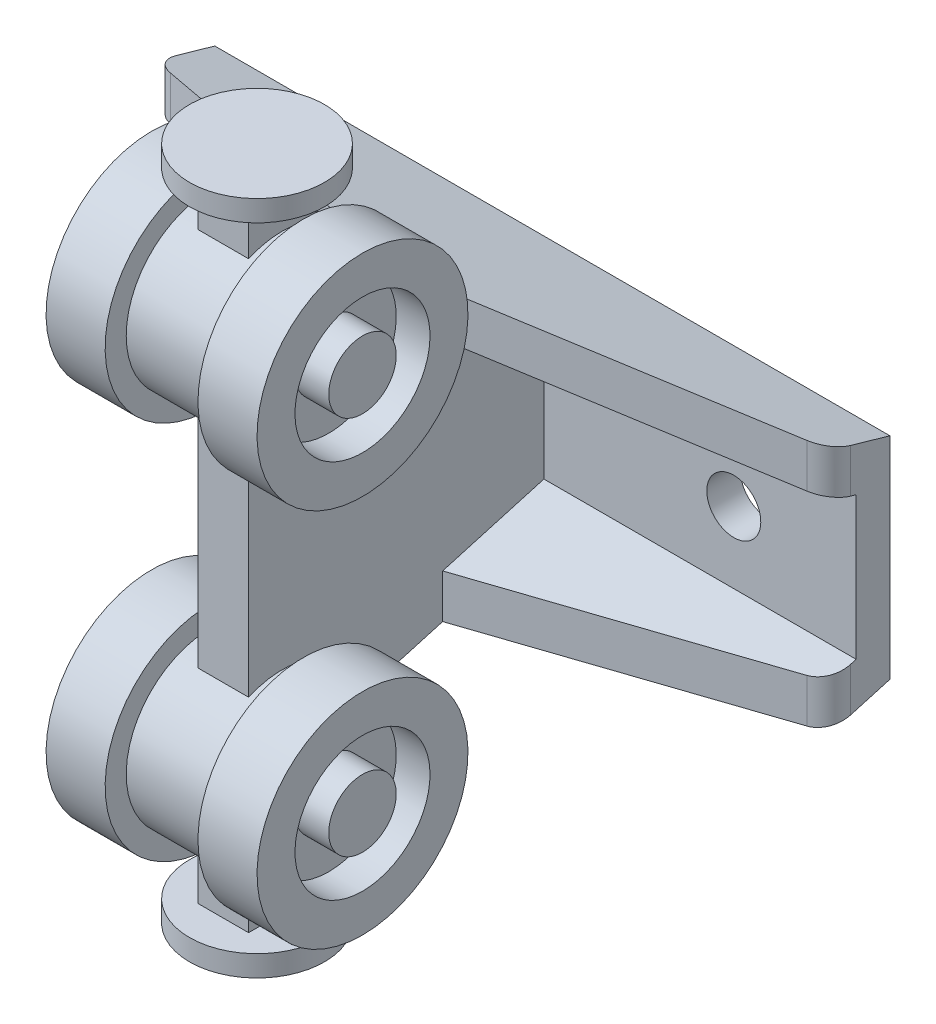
ISO-10303-21;
HEADER;
FILE_DESCRIPTION(('STEP AP214'),'2;1');
FILE_NAME('part.step','',(''),(''),'','','');
FILE_SCHEMA(('AUTOMOTIVE_DESIGN { 1 0 10303 214 1 1 1 1 }'));
ENDSEC;
DATA;
#1=APPLICATION_CONTEXT('core data for automotive mechanical design processes');
#2=APPLICATION_PROTOCOL_DEFINITION('international standard','automotive_design',2000,#1);
#3=PRODUCT_CONTEXT('',#1,'mechanical');
#4=PRODUCT('Part','Part','',(#3));
#5=PRODUCT_RELATED_PRODUCT_CATEGORY('part','',(#4));
#6=PRODUCT_DEFINITION_FORMATION('','',#4);
#7=PRODUCT_DEFINITION_CONTEXT('part definition',#1,'design');
#8=PRODUCT_DEFINITION('design','',#6,#7);
#9=PRODUCT_DEFINITION_SHAPE('','',#8);
#10=(LENGTH_UNIT() NAMED_UNIT(*) SI_UNIT(.MILLI.,.METRE.));
#11=(NAMED_UNIT(*) PLANE_ANGLE_UNIT() SI_UNIT($,.RADIAN.));
#12=(NAMED_UNIT(*) SI_UNIT($,.STERADIAN.) SOLID_ANGLE_UNIT());
#13=UNCERTAINTY_MEASURE_WITH_UNIT(LENGTH_MEASURE(1.E-05),#10,'distance_accuracy_value','');
#14=(GEOMETRIC_REPRESENTATION_CONTEXT(3) GLOBAL_UNCERTAINTY_ASSIGNED_CONTEXT((#13)) GLOBAL_UNIT_ASSIGNED_CONTEXT((#10,
#11,#12)) REPRESENTATION_CONTEXT('',''));
#15=CARTESIAN_POINT('',(0.,0.,0.));
#16=DIRECTION('',(0.,0.,1.));
#17=DIRECTION('',(1.,0.,0.));
#18=AXIS2_PLACEMENT_3D('',#15,#16,#17);
#19=CARTESIAN_POINT('',(-12.5,43.,0.));
#20=DIRECTION('',(-1.,0.,0.));
#21=DIRECTION('',(0.,0.,1.));
#22=AXIS2_PLACEMENT_3D('',#19,#20,#21);
#23=PLANE('',#22);
#24=CARTESIAN_POINT('',(-12.5,45.,0.));
#25=DIRECTION('',(1.,0.,0.));
#26=DIRECTION('',(0.,0.,-1.));
#27=AXIS2_PLACEMENT_3D('',#24,#25,#26);
#28=CIRCLE('',#27,4.);
#29=CARTESIAN_POINT('',(-12.5,49.,0.));
#30=VERTEX_POINT('',#29);
#31=EDGE_CURVE('E18',#30,#30,#28,.T.);
#32=ORIENTED_EDGE('',*,*,#31,.F.);
#33=EDGE_LOOP('',(#32));
#34=FACE_BOUND('',#33,.T.);
#35=ADVANCED_FACE('F15',(#34),#23,.T.);
#36=CARTESIAN_POINT('',(12.5,43.,0.));
#37=DIRECTION('',(1.,0.,0.));
#38=DIRECTION('',(0.,0.,-1.));
#39=AXIS2_PLACEMENT_3D('',#36,#37,#38);
#40=PLANE('',#39);
#41=CARTESIAN_POINT('',(12.5,45.,0.));
#42=DIRECTION('',(1.,0.,0.));
#43=DIRECTION('',(0.,0.,-1.));
#44=AXIS2_PLACEMENT_3D('',#41,#42,#43);
#45=CIRCLE('',#44,4.);
#46=CARTESIAN_POINT('',(12.5,49.,0.));
#47=VERTEX_POINT('',#46);
#48=EDGE_CURVE('E34',#47,#47,#45,.F.);
#49=ORIENTED_EDGE('',*,*,#48,.F.);
#50=EDGE_LOOP('',(#49));
#51=FACE_BOUND('',#50,.T.);
#52=ADVANCED_FACE('F858',(#51),#40,.T.);
#53=CARTESIAN_POINT('',(12.5,2.,0.));
#54=DIRECTION('',(1.,0.,0.));
#55=DIRECTION('',(0.,0.,-1.));
#56=AXIS2_PLACEMENT_3D('',#53,#54,#55);
#57=PLANE('',#56);
#58=CARTESIAN_POINT('',(12.5,0.,0.));
#59=DIRECTION('',(-1.,0.,0.));
#60=DIRECTION('',(0.,0.,1.));
#61=AXIS2_PLACEMENT_3D('',#58,#59,#60);
#62=CIRCLE('',#61,4.);
#63=CARTESIAN_POINT('',(12.5,-4.,0.));
#64=VERTEX_POINT('',#63);
#65=EDGE_CURVE('E588',#64,#64,#62,.T.);
#66=ORIENTED_EDGE('',*,*,#65,.F.);
#67=EDGE_LOOP('',(#66));
#68=FACE_BOUND('',#67,.T.);
#69=ADVANCED_FACE('F605',(#68),#57,.T.);
#70=CARTESIAN_POINT('',(-12.5,2.,0.));
#71=DIRECTION('',(-1.,0.,0.));
#72=DIRECTION('',(0.,0.,1.));
#73=AXIS2_PLACEMENT_3D('',#70,#71,#72);
#74=PLANE('',#73);
#75=CARTESIAN_POINT('',(-12.5,0.,0.));
#76=DIRECTION('',(-1.,0.,0.));
#77=DIRECTION('',(0.,0.,1.));
#78=AXIS2_PLACEMENT_3D('',#75,#76,#77);
#79=CIRCLE('',#78,4.);
#80=CARTESIAN_POINT('',(-12.5,-4.,0.));
#81=VERTEX_POINT('',#80);
#82=EDGE_CURVE('E585',#81,#81,#79,.F.);
#83=ORIENTED_EDGE('',*,*,#82,.F.);
#84=EDGE_LOOP('',(#83));
#85=FACE_BOUND('',#84,.T.);
#86=ADVANCED_FACE('F595',(#85),#74,.T.);
#87=CARTESIAN_POINT('',(-10.5,45.,0.));
#88=DIRECTION('',(1.,0.,0.));
#89=DIRECTION('',(0.,0.,-1.));
#90=AXIS2_PLACEMENT_3D('',#87,#88,#89);
#91=CYLINDRICAL_SURFACE('',#90,4.);
#92=CARTESIAN_POINT('',(-8.5,45.,0.));
#93=DIRECTION('',(1.,0.,0.));
#94=DIRECTION('',(0.,0.,-1.));
#95=AXIS2_PLACEMENT_3D('',#92,#93,#94);
#96=CIRCLE('',#95,4.);
#97=CARTESIAN_POINT('',(-8.5,49.,0.));
#98=VERTEX_POINT('',#97);
#99=EDGE_CURVE('E582',#98,#98,#96,.T.);
#100=ORIENTED_EDGE('',*,*,#99,.F.);
#101=EDGE_LOOP('',(#100));
#102=FACE_BOUND('',#101,.T.);
#103=ORIENTED_EDGE('',*,*,#31,.T.);
#104=EDGE_LOOP('',(#103));
#105=FACE_BOUND('',#104,.T.);
#106=ADVANCED_FACE('F592',(#102,#105),#91,.T.);
#107=CARTESIAN_POINT('',(10.5,45.,0.));
#108=DIRECTION('',(1.,0.,0.));
#109=DIRECTION('',(0.,0.,-1.));
#110=AXIS2_PLACEMENT_3D('',#107,#108,#109);
#111=CYLINDRICAL_SURFACE('',#110,4.);
#112=ORIENTED_EDGE('',*,*,#48,.T.);
#113=EDGE_LOOP('',(#112));
#114=FACE_BOUND('',#113,.T.);
#115=CARTESIAN_POINT('',(8.5,45.,0.));
#116=DIRECTION('',(1.,0.,0.));
#117=DIRECTION('',(0.,0.,-1.));
#118=AXIS2_PLACEMENT_3D('',#115,#116,#117);
#119=CIRCLE('',#118,4.);
#120=CARTESIAN_POINT('',(8.5,49.,0.));
#121=VERTEX_POINT('',#120);
#122=EDGE_CURVE('E579',#121,#121,#119,.F.);
#123=ORIENTED_EDGE('',*,*,#122,.F.);
#124=EDGE_LOOP('',(#123));
#125=FACE_BOUND('',#124,.T.);
#126=ADVANCED_FACE('F594',(#114,#125),#111,.T.);
#127=CARTESIAN_POINT('',(10.5,0.,0.));
#128=DIRECTION('',(-1.,0.,0.));
#129=DIRECTION('',(0.,0.,1.));
#130=AXIS2_PLACEMENT_3D('',#127,#128,#129);
#131=CYLINDRICAL_SURFACE('',#130,4.);
#132=CARTESIAN_POINT('',(8.5,0.,0.));
#133=DIRECTION('',(-1.,0.,0.));
#134=DIRECTION('',(0.,0.,1.));
#135=AXIS2_PLACEMENT_3D('',#132,#133,#134);
#136=CIRCLE('',#135,4.);
#137=CARTESIAN_POINT('',(8.5,-4.,0.));
#138=VERTEX_POINT('',#137);
#139=EDGE_CURVE('E576',#138,#138,#136,.T.);
#140=ORIENTED_EDGE('',*,*,#139,.F.);
#141=EDGE_LOOP('',(#140));
#142=FACE_BOUND('',#141,.T.);
#143=ORIENTED_EDGE('',*,*,#65,.T.);
#144=EDGE_LOOP('',(#143));
#145=FACE_BOUND('',#144,.T.);
#146=ADVANCED_FACE('F603',(#142,#145),#131,.T.);
#147=CARTESIAN_POINT('',(-10.5,0.,0.));
#148=DIRECTION('',(-1.,0.,0.));
#149=DIRECTION('',(0.,0.,1.));
#150=AXIS2_PLACEMENT_3D('',#147,#148,#149);
#151=CYLINDRICAL_SURFACE('',#150,4.);
#152=ORIENTED_EDGE('',*,*,#82,.T.);
#153=EDGE_LOOP('',(#152));
#154=FACE_BOUND('',#153,.T.);
#155=CARTESIAN_POINT('',(-8.5,0.,0.));
#156=DIRECTION('',(-1.,0.,0.));
#157=DIRECTION('',(0.,0.,1.));
#158=AXIS2_PLACEMENT_3D('',#155,#156,#157);
#159=CIRCLE('',#158,4.);
#160=CARTESIAN_POINT('',(-8.5,-4.,0.));
#161=VERTEX_POINT('',#160);
#162=EDGE_CURVE('E573',#161,#161,#159,.F.);
#163=ORIENTED_EDGE('',*,*,#162,.F.);
#164=EDGE_LOOP('',(#163));
#165=FACE_BOUND('',#164,.T.);
#166=ADVANCED_FACE('F846',(#154,#165),#151,.T.);
#167=CARTESIAN_POINT('',(-8.5,39.,0.));
#168=DIRECTION('',(-1.,0.,0.));
#169=DIRECTION('',(0.,0.,1.));
#170=AXIS2_PLACEMENT_3D('',#167,#168,#169);
#171=PLANE('',#170);
#172=ORIENTED_EDGE('',*,*,#99,.T.);
#173=EDGE_LOOP('',(#172));
#174=FACE_BOUND('',#173,.T.);
#175=CARTESIAN_POINT('',(-8.5,45.,0.));
#176=DIRECTION('',(1.,0.,0.));
#177=DIRECTION('',(0.,0.,-1.));
#178=AXIS2_PLACEMENT_3D('',#175,#176,#177);
#179=CIRCLE('',#178,8.);
#180=CARTESIAN_POINT('',(-8.5,53.,0.));
#181=VERTEX_POINT('',#180);
#182=EDGE_CURVE('E571',#181,#181,#179,.F.);
#183=ORIENTED_EDGE('',*,*,#182,.T.);
#184=EDGE_LOOP('',(#183));
#185=FACE_BOUND('',#184,.T.);
#186=ADVANCED_FACE('F842',(#174,#185),#171,.T.);
#187=CARTESIAN_POINT('',(8.5,39.,0.));
#188=DIRECTION('',(1.,0.,0.));
#189=DIRECTION('',(0.,0.,-1.));
#190=AXIS2_PLACEMENT_3D('',#187,#188,#189);
#191=PLANE('',#190);
#192=ORIENTED_EDGE('',*,*,#122,.T.);
#193=EDGE_LOOP('',(#192));
#194=FACE_BOUND('',#193,.T.);
#195=CARTESIAN_POINT('',(8.5,45.,0.));
#196=DIRECTION('',(1.,0.,0.));
#197=DIRECTION('',(0.,0.,-1.));
#198=AXIS2_PLACEMENT_3D('',#195,#196,#197);
#199=CIRCLE('',#198,8.);
#200=CARTESIAN_POINT('',(8.5,53.,0.));
#201=VERTEX_POINT('',#200);
#202=EDGE_CURVE('E569',#201,#201,#199,.T.);
#203=ORIENTED_EDGE('',*,*,#202,.T.);
#204=EDGE_LOOP('',(#203));
#205=FACE_BOUND('',#204,.T.);
#206=ADVANCED_FACE('F838',(#194,#205),#191,.T.);
#207=CARTESIAN_POINT('',(8.5,6.,0.));
#208=DIRECTION('',(1.,0.,0.));
#209=DIRECTION('',(0.,0.,-1.));
#210=AXIS2_PLACEMENT_3D('',#207,#208,#209);
#211=PLANE('',#210);
#212=ORIENTED_EDGE('',*,*,#139,.T.);
#213=EDGE_LOOP('',(#212));
#214=FACE_BOUND('',#213,.T.);
#215=CARTESIAN_POINT('',(8.5,0.,0.));
#216=DIRECTION('',(-1.,0.,0.));
#217=DIRECTION('',(0.,0.,1.));
#218=AXIS2_PLACEMENT_3D('',#215,#216,#217);
#219=CIRCLE('',#218,8.);
#220=CARTESIAN_POINT('',(8.5,-8.,0.));
#221=VERTEX_POINT('',#220);
#222=EDGE_CURVE('E567',#221,#221,#219,.F.);
#223=ORIENTED_EDGE('',*,*,#222,.T.);
#224=EDGE_LOOP('',(#223));
#225=FACE_BOUND('',#224,.T.);
#226=ADVANCED_FACE('F834',(#214,#225),#211,.T.);
#227=CARTESIAN_POINT('',(-8.5,6.,0.));
#228=DIRECTION('',(-1.,0.,0.));
#229=DIRECTION('',(0.,0.,1.));
#230=AXIS2_PLACEMENT_3D('',#227,#228,#229);
#231=PLANE('',#230);
#232=ORIENTED_EDGE('',*,*,#162,.T.);
#233=EDGE_LOOP('',(#232));
#234=FACE_BOUND('',#233,.T.);
#235=CARTESIAN_POINT('',(-8.5,0.,0.));
#236=DIRECTION('',(-1.,0.,0.));
#237=DIRECTION('',(0.,0.,1.));
#238=AXIS2_PLACEMENT_3D('',#235,#236,#237);
#239=CIRCLE('',#238,8.);
#240=CARTESIAN_POINT('',(-8.5,-8.,0.));
#241=VERTEX_POINT('',#240);
#242=EDGE_CURVE('E565',#241,#241,#239,.T.);
#243=ORIENTED_EDGE('',*,*,#242,.T.);
#244=EDGE_LOOP('',(#243));
#245=FACE_BOUND('',#244,.T.);
#246=ADVANCED_FACE('F830',(#234,#245),#231,.T.);
#247=CARTESIAN_POINT('',(-10.5,45.,0.));
#248=DIRECTION('',(1.,0.,0.));
#249=DIRECTION('',(0.,0.,-1.));
#250=AXIS2_PLACEMENT_3D('',#247,#248,#249);
#251=CYLINDRICAL_SURFACE('',#250,8.);
#252=ORIENTED_EDGE('',*,*,#182,.F.);
#253=EDGE_LOOP('',(#252));
#254=FACE_BOUND('',#253,.T.);
#255=CARTESIAN_POINT('',(-12.5,45.,0.));
#256=DIRECTION('',(1.,0.,0.));
#257=DIRECTION('',(0.,0.,-1.));
#258=AXIS2_PLACEMENT_3D('',#255,#256,#257);
#259=CIRCLE('',#258,8.);
#260=CARTESIAN_POINT('',(-12.5,53.,0.));
#261=VERTEX_POINT('',#260);
#262=EDGE_CURVE('E562',#261,#261,#259,.T.);
#263=ORIENTED_EDGE('',*,*,#262,.F.);
#264=EDGE_LOOP('',(#263));
#265=FACE_BOUND('',#264,.T.);
#266=ADVANCED_FACE('F826',(#254,#265),#251,.F.);
#267=CARTESIAN_POINT('',(0.,62.5,0.));
#268=DIRECTION('',(0.,1.,0.));
#269=DIRECTION('',(0.,0.,1.));
#270=AXIS2_PLACEMENT_3D('',#267,#268,#269);
#271=PLANE('',#270);
#272=CARTESIAN_POINT('',(0.,62.5,0.));
#273=DIRECTION('',(0.,1.,0.));
#274=DIRECTION('',(0.,0.,1.));
#275=AXIS2_PLACEMENT_3D('',#272,#273,#274);
#276=CIRCLE('',#275,8.);
#277=CARTESIAN_POINT('',(0.,62.5,8.));
#278=VERTEX_POINT('',#277);
#279=EDGE_CURVE('E559',#278,#278,#276,.F.);
#280=ORIENTED_EDGE('',*,*,#279,.F.);
#281=EDGE_LOOP('',(#280));
#282=FACE_BOUND('',#281,.T.);
#283=ADVANCED_FACE('F822',(#282),#271,.T.);
#284=CARTESIAN_POINT('',(10.5,45.,0.));
#285=DIRECTION('',(1.,0.,0.));
#286=DIRECTION('',(0.,0.,-1.));
#287=AXIS2_PLACEMENT_3D('',#284,#285,#286);
#288=CYLINDRICAL_SURFACE('',#287,8.);
#289=CARTESIAN_POINT('',(12.5,45.,0.));
#290=DIRECTION('',(1.,0.,0.));
#291=DIRECTION('',(0.,0.,-1.));
#292=AXIS2_PLACEMENT_3D('',#289,#290,#291);
#293=CIRCLE('',#292,8.);
#294=CARTESIAN_POINT('',(12.5,53.,0.));
#295=VERTEX_POINT('',#294);
#296=EDGE_CURVE('E556',#295,#295,#293,.F.);
#297=ORIENTED_EDGE('',*,*,#296,.F.);
#298=EDGE_LOOP('',(#297));
#299=FACE_BOUND('',#298,.T.);
#300=ORIENTED_EDGE('',*,*,#202,.F.);
#301=EDGE_LOOP('',(#300));
#302=FACE_BOUND('',#301,.T.);
#303=ADVANCED_FACE('F818',(#299,#302),#288,.F.);
#304=CARTESIAN_POINT('',(10.5,0.,0.));
#305=DIRECTION('',(-1.,0.,0.));
#306=DIRECTION('',(0.,0.,1.));
#307=AXIS2_PLACEMENT_3D('',#304,#305,#306);
#308=CYLINDRICAL_SURFACE('',#307,8.);
#309=ORIENTED_EDGE('',*,*,#222,.F.);
#310=EDGE_LOOP('',(#309));
#311=FACE_BOUND('',#310,.T.);
#312=CARTESIAN_POINT('',(12.5,0.,0.));
#313=DIRECTION('',(-1.,0.,0.));
#314=DIRECTION('',(0.,0.,1.));
#315=AXIS2_PLACEMENT_3D('',#312,#313,#314);
#316=CIRCLE('',#315,8.);
#317=CARTESIAN_POINT('',(12.5,-8.,0.));
#318=VERTEX_POINT('',#317);
#319=EDGE_CURVE('E553',#318,#318,#316,.T.);
#320=ORIENTED_EDGE('',*,*,#319,.F.);
#321=EDGE_LOOP('',(#320));
#322=FACE_BOUND('',#321,.T.);
#323=ADVANCED_FACE('F814',(#311,#322),#308,.F.);
#324=CARTESIAN_POINT('',(0.,-17.5,0.));
#325=DIRECTION('',(0.,-1.,0.));
#326=DIRECTION('',(0.,0.,-1.));
#327=AXIS2_PLACEMENT_3D('',#324,#325,#326);
#328=PLANE('',#327);
#329=CARTESIAN_POINT('',(0.,-17.5,0.));
#330=DIRECTION('',(0.,-1.,0.));
#331=DIRECTION('',(0.,0.,-1.));
#332=AXIS2_PLACEMENT_3D('',#329,#330,#331);
#333=CIRCLE('',#332,8.);
#334=CARTESIAN_POINT('',(0.,-17.5,8.));
#335=VERTEX_POINT('',#334);
#336=EDGE_CURVE('E550',#335,#335,#333,.F.);
#337=ORIENTED_EDGE('',*,*,#336,.F.);
#338=EDGE_LOOP('',(#337));
#339=FACE_BOUND('',#338,.T.);
#340=ADVANCED_FACE('F810',(#339),#328,.T.);
#341=CARTESIAN_POINT('',(-10.5,0.,0.));
#342=DIRECTION('',(-1.,0.,0.));
#343=DIRECTION('',(0.,0.,1.));
#344=AXIS2_PLACEMENT_3D('',#341,#342,#343);
#345=CYLINDRICAL_SURFACE('',#344,8.);
#346=CARTESIAN_POINT('',(-12.5,0.,0.));
#347=DIRECTION('',(-1.,0.,0.));
#348=DIRECTION('',(0.,0.,1.));
#349=AXIS2_PLACEMENT_3D('',#346,#347,#348);
#350=CIRCLE('',#349,8.);
#351=CARTESIAN_POINT('',(-12.5,-8.,0.));
#352=VERTEX_POINT('',#351);
#353=EDGE_CURVE('E547',#352,#352,#350,.F.);
#354=ORIENTED_EDGE('',*,*,#353,.F.);
#355=EDGE_LOOP('',(#354));
#356=FACE_BOUND('',#355,.T.);
#357=ORIENTED_EDGE('',*,*,#242,.F.);
#358=EDGE_LOOP('',(#357));
#359=FACE_BOUND('',#358,.T.);
#360=ADVANCED_FACE('F806',(#356,#359),#345,.F.);
#361=CARTESIAN_POINT('',(-12.5,34.75,0.));
#362=DIRECTION('',(-1.,0.,0.));
#363=DIRECTION('',(0.,0.,1.));
#364=AXIS2_PLACEMENT_3D('',#361,#362,#363);
#365=PLANE('',#364);
#366=ORIENTED_EDGE('',*,*,#262,.T.);
#367=EDGE_LOOP('',(#366));
#368=FACE_BOUND('',#367,.T.);
#369=CARTESIAN_POINT('',(-12.5,45.,0.));
#370=DIRECTION('',(1.,0.,0.));
#371=DIRECTION('',(0.,0.,-1.));
#372=AXIS2_PLACEMENT_3D('',#369,#370,#371);
#373=CIRCLE('',#372,12.5);
#374=CARTESIAN_POINT('',(-12.5,57.5,0.));
#375=VERTEX_POINT('',#374);
#376=EDGE_CURVE('E544',#375,#375,#373,.T.);
#377=ORIENTED_EDGE('',*,*,#376,.F.);
#378=EDGE_LOOP('',(#377));
#379=FACE_BOUND('',#378,.T.);
#380=ADVANCED_FACE('F802',(#368,#379),#365,.T.);
#381=CARTESIAN_POINT('',(0.,61.25,0.));
#382=DIRECTION('',(0.,1.,0.));
#383=DIRECTION('',(0.,0.,1.));
#384=AXIS2_PLACEMENT_3D('',#381,#382,#383);
#385=CYLINDRICAL_SURFACE('',#384,8.);
#386=ORIENTED_EDGE('',*,*,#279,.T.);
#387=EDGE_LOOP('',(#386));
#388=FACE_BOUND('',#387,.T.);
#389=CARTESIAN_POINT('',(0.,60.,0.));
#390=DIRECTION('',(0.,1.,0.));
#391=DIRECTION('',(0.,0.,1.));
#392=AXIS2_PLACEMENT_3D('',#389,#390,#391);
#393=CIRCLE('',#392,8.);
#394=CARTESIAN_POINT('',(0.,60.,8.));
#395=VERTEX_POINT('',#394);
#396=EDGE_CURVE('E541',#395,#395,#393,.F.);
#397=ORIENTED_EDGE('',*,*,#396,.F.);
#398=EDGE_LOOP('',(#397));
#399=FACE_BOUND('',#398,.T.);
#400=ADVANCED_FACE('F798',(#388,#399),#385,.T.);
#401=CARTESIAN_POINT('',(12.5,34.75,0.));
#402=DIRECTION('',(1.,0.,0.));
#403=DIRECTION('',(0.,0.,-1.));
#404=AXIS2_PLACEMENT_3D('',#401,#402,#403);
#405=PLANE('',#404);
#406=ORIENTED_EDGE('',*,*,#296,.T.);
#407=EDGE_LOOP('',(#406));
#408=FACE_BOUND('',#407,.T.);
#409=CARTESIAN_POINT('',(12.5,45.,0.));
#410=DIRECTION('',(1.,0.,0.));
#411=DIRECTION('',(0.,0.,-1.));
#412=AXIS2_PLACEMENT_3D('',#409,#410,#411);
#413=CIRCLE('',#412,12.5);
#414=CARTESIAN_POINT('',(12.5,57.5,0.));
#415=VERTEX_POINT('',#414);
#416=EDGE_CURVE('E538',#415,#415,#413,.F.);
#417=ORIENTED_EDGE('',*,*,#416,.F.);
#418=EDGE_LOOP('',(#417));
#419=FACE_BOUND('',#418,.T.);
#420=ADVANCED_FACE('F794',(#408,#419),#405,.T.);
#421=CARTESIAN_POINT('',(12.5,10.25,0.));
#422=DIRECTION('',(1.,0.,0.));
#423=DIRECTION('',(0.,0.,-1.));
#424=AXIS2_PLACEMENT_3D('',#421,#422,#423);
#425=PLANE('',#424);
#426=ORIENTED_EDGE('',*,*,#319,.T.);
#427=EDGE_LOOP('',(#426));
#428=FACE_BOUND('',#427,.T.);
#429=CARTESIAN_POINT('',(12.5,0.,0.));
#430=DIRECTION('',(-1.,0.,0.));
#431=DIRECTION('',(0.,0.,1.));
#432=AXIS2_PLACEMENT_3D('',#429,#430,#431);
#433=CIRCLE('',#432,12.5);
#434=CARTESIAN_POINT('',(12.5,-12.5,0.));
#435=VERTEX_POINT('',#434);
#436=EDGE_CURVE('E535',#435,#435,#433,.T.);
#437=ORIENTED_EDGE('',*,*,#436,.F.);
#438=EDGE_LOOP('',(#437));
#439=FACE_BOUND('',#438,.T.);
#440=ADVANCED_FACE('F790',(#428,#439),#425,.T.);
#441=CARTESIAN_POINT('',(0.,-16.25,0.));
#442=DIRECTION('',(0.,-1.,0.));
#443=DIRECTION('',(0.,0.,-1.));
#444=AXIS2_PLACEMENT_3D('',#441,#442,#443);
#445=CYLINDRICAL_SURFACE('',#444,8.);
#446=ORIENTED_EDGE('',*,*,#336,.T.);
#447=EDGE_LOOP('',(#446));
#448=FACE_BOUND('',#447,.T.);
#449=CARTESIAN_POINT('',(0.,-15.,0.));
#450=DIRECTION('',(0.,-1.,0.));
#451=DIRECTION('',(0.,0.,-1.));
#452=AXIS2_PLACEMENT_3D('',#449,#450,#451);
#453=CIRCLE('',#452,8.);
#454=CARTESIAN_POINT('',(0.,-15.,8.));
#455=VERTEX_POINT('',#454);
#456=EDGE_CURVE('E532',#455,#455,#453,.F.);
#457=ORIENTED_EDGE('',*,*,#456,.F.);
#458=EDGE_LOOP('',(#457));
#459=FACE_BOUND('',#458,.T.);
#460=ADVANCED_FACE('F786',(#448,#459),#445,.T.);
#461=CARTESIAN_POINT('',(-12.5,10.25,0.));
#462=DIRECTION('',(-1.,0.,0.));
#463=DIRECTION('',(0.,0.,1.));
#464=AXIS2_PLACEMENT_3D('',#461,#462,#463);
#465=PLANE('',#464);
#466=ORIENTED_EDGE('',*,*,#353,.T.);
#467=EDGE_LOOP('',(#466));
#468=FACE_BOUND('',#467,.T.);
#469=CARTESIAN_POINT('',(-12.5,0.,0.));
#470=DIRECTION('',(-1.,0.,0.));
#471=DIRECTION('',(0.,0.,1.));
#472=AXIS2_PLACEMENT_3D('',#469,#470,#471);
#473=CIRCLE('',#472,12.5);
#474=CARTESIAN_POINT('',(-12.5,-12.5,0.));
#475=VERTEX_POINT('',#474);
#476=EDGE_CURVE('E529',#475,#475,#473,.F.);
#477=ORIENTED_EDGE('',*,*,#476,.F.);
#478=EDGE_LOOP('',(#477));
#479=FACE_BOUND('',#478,.T.);
#480=ADVANCED_FACE('F782',(#468,#479),#465,.T.);
#481=CARTESIAN_POINT('',(-9.,45.,0.));
#482=DIRECTION('',(1.,0.,0.));
#483=DIRECTION('',(0.,0.,-1.));
#484=AXIS2_PLACEMENT_3D('',#481,#482,#483);
#485=CYLINDRICAL_SURFACE('',#484,12.5);
#486=CARTESIAN_POINT('',(-5.5,45.,0.));
#487=DIRECTION('',(1.,0.,0.));
#488=DIRECTION('',(0.,0.,-1.));
#489=AXIS2_PLACEMENT_3D('',#486,#487,#488);
#490=CIRCLE('',#489,12.5);
#491=CARTESIAN_POINT('',(-5.5,57.5,0.));
#492=VERTEX_POINT('',#491);
#493=EDGE_CURVE('E407',#492,#492,#490,.T.);
#494=ORIENTED_EDGE('',*,*,#493,.F.);
#495=EDGE_LOOP('',(#494));
#496=FACE_BOUND('',#495,.T.);
#497=ORIENTED_EDGE('',*,*,#376,.T.);
#498=EDGE_LOOP('',(#497));
#499=FACE_BOUND('',#498,.T.);
#500=ADVANCED_FACE('F778',(#496,#499),#485,.T.);
#501=CARTESIAN_POINT('',(0.,60.,0.));
#502=DIRECTION('',(0.,-1.,0.));
#503=DIRECTION('',(0.,0.,-1.));
#504=AXIS2_PLACEMENT_3D('',#501,#502,#503);
#505=PLANE('',#504);
#506=DIRECTION('',(1.,0.,0.));
#507=VECTOR('',#506,1.);
#508=CARTESIAN_POINT('',(0.,60.,4.));
#509=LINE('',#508,#507);
#510=CARTESIAN_POINT('',(3.,60.,4.));
#511=VERTEX_POINT('',#510);
#512=CARTESIAN_POINT('',(-3.,60.,4.));
#513=VERTEX_POINT('',#512);
#514=EDGE_CURVE('E410',#511,#513,#509,.F.);
#515=ORIENTED_EDGE('',*,*,#514,.F.);
#516=DIRECTION('',(0.,0.,1.));
#517=VECTOR('',#516,1.);
#518=CARTESIAN_POINT('',(3.,60.,0.));
#519=LINE('',#518,#517);
#520=CARTESIAN_POINT('',(3.,60.,-4.));
#521=VERTEX_POINT('',#520);
#522=EDGE_CURVE('E417',#511,#521,#519,.F.);
#523=ORIENTED_EDGE('',*,*,#522,.T.);
#524=DIRECTION('',(1.,0.,0.));
#525=VECTOR('',#524,1.);
#526=CARTESIAN_POINT('',(0.,60.,-4.));
#527=LINE('',#526,#525);
#528=CARTESIAN_POINT('',(-3.,60.,-4.));
#529=VERTEX_POINT('',#528);
#530=EDGE_CURVE('E406',#521,#529,#527,.F.);
#531=ORIENTED_EDGE('',*,*,#530,.T.);
#532=DIRECTION('',(0.,0.,-1.));
#533=VECTOR('',#532,1.);
#534=CARTESIAN_POINT('',(-3.,60.,0.));
#535=LINE('',#534,#533);
#536=EDGE_CURVE('E404',#529,#513,#535,.F.);
#537=ORIENTED_EDGE('',*,*,#536,.T.);
#538=EDGE_LOOP('',(#515,#523,#531,#537));
#539=FACE_BOUND('',#538,.T.);
#540=ORIENTED_EDGE('',*,*,#396,.T.);
#541=EDGE_LOOP('',(#540));
#542=FACE_BOUND('',#541,.T.);
#543=ADVANCED_FACE('F774',(#539,#542),#505,.T.);
#544=CARTESIAN_POINT('',(9.,45.,0.));
#545=DIRECTION('',(1.,0.,0.));
#546=DIRECTION('',(0.,0.,-1.));
#547=AXIS2_PLACEMENT_3D('',#544,#545,#546);
#548=CYLINDRICAL_SURFACE('',#547,12.5);
#549=ORIENTED_EDGE('',*,*,#416,.T.);
#550=EDGE_LOOP('',(#549));
#551=FACE_BOUND('',#550,.T.);
#552=CARTESIAN_POINT('',(5.5,45.,0.));
#553=DIRECTION('',(1.,0.,0.));
#554=DIRECTION('',(0.,0.,-1.));
#555=AXIS2_PLACEMENT_3D('',#552,#553,#554);
#556=CIRCLE('',#555,12.5);
#557=CARTESIAN_POINT('',(5.5,57.5,0.));
#558=VERTEX_POINT('',#557);
#559=EDGE_CURVE('E524',#558,#558,#556,.F.);
#560=ORIENTED_EDGE('',*,*,#559,.F.);
#561=EDGE_LOOP('',(#560));
#562=FACE_BOUND('',#561,.T.);
#563=ADVANCED_FACE('F770',(#551,#562),#548,.T.);
#564=CARTESIAN_POINT('',(9.,0.,0.));
#565=DIRECTION('',(-1.,0.,0.));
#566=DIRECTION('',(0.,0.,1.));
#567=AXIS2_PLACEMENT_3D('',#564,#565,#566);
#568=CYLINDRICAL_SURFACE('',#567,12.5);
#569=CARTESIAN_POINT('',(5.5,0.,0.));
#570=DIRECTION('',(-1.,0.,0.));
#571=DIRECTION('',(0.,0.,1.));
#572=AXIS2_PLACEMENT_3D('',#569,#570,#571);
#573=CIRCLE('',#572,12.5);
#574=CARTESIAN_POINT('',(5.5,-12.5,0.));
#575=VERTEX_POINT('',#574);
#576=EDGE_CURVE('E385',#575,#575,#573,.T.);
#577=ORIENTED_EDGE('',*,*,#576,.F.);
#578=EDGE_LOOP('',(#577));
#579=FACE_BOUND('',#578,.T.);
#580=ORIENTED_EDGE('',*,*,#436,.T.);
#581=EDGE_LOOP('',(#580));
#582=FACE_BOUND('',#581,.T.);
#583=ADVANCED_FACE('F766',(#579,#582),#568,.T.);
#584=CARTESIAN_POINT('',(0.,-15.,0.));
#585=DIRECTION('',(0.,1.,0.));
#586=DIRECTION('',(0.,0.,1.));
#587=AXIS2_PLACEMENT_3D('',#584,#585,#586);
#588=PLANE('',#587);
#589=DIRECTION('',(1.,0.,0.));
#590=VECTOR('',#589,1.);
#591=CARTESIAN_POINT('',(0.,-15.,4.));
#592=LINE('',#591,#590);
#593=CARTESIAN_POINT('',(-3.,-15.,4.));
#594=VERTEX_POINT('',#593);
#595=CARTESIAN_POINT('',(3.,-15.,4.));
#596=VERTEX_POINT('',#595);
#597=EDGE_CURVE('E388',#594,#596,#592,.T.);
#598=ORIENTED_EDGE('',*,*,#597,.F.);
#599=DIRECTION('',(0.,0.,-1.));
#600=VECTOR('',#599,1.);
#601=CARTESIAN_POINT('',(-3.,-15.,0.));
#602=LINE('',#601,#600);
#603=CARTESIAN_POINT('',(-3.,-15.,-4.));
#604=VERTEX_POINT('',#603);
#605=EDGE_CURVE('E395',#594,#604,#602,.T.);
#606=ORIENTED_EDGE('',*,*,#605,.T.);
#607=DIRECTION('',(1.,0.,0.));
#608=VECTOR('',#607,1.);
#609=CARTESIAN_POINT('',(0.,-15.,-4.));
#610=LINE('',#609,#608);
#611=CARTESIAN_POINT('',(3.,-15.,-4.));
#612=VERTEX_POINT('',#611);
#613=EDGE_CURVE('E384',#604,#612,#610,.T.);
#614=ORIENTED_EDGE('',*,*,#613,.T.);
#615=DIRECTION('',(0.,0.,1.));
#616=VECTOR('',#615,1.);
#617=CARTESIAN_POINT('',(3.,-15.,0.));
#618=LINE('',#617,#616);
#619=EDGE_CURVE('E382',#612,#596,#618,.T.);
#620=ORIENTED_EDGE('',*,*,#619,.T.);
#621=EDGE_LOOP('',(#598,#606,#614,#620));
#622=FACE_BOUND('',#621,.T.);
#623=ORIENTED_EDGE('',*,*,#456,.T.);
#624=EDGE_LOOP('',(#623));
#625=FACE_BOUND('',#624,.T.);
#626=ADVANCED_FACE('F762',(#622,#625),#588,.T.);
#627=CARTESIAN_POINT('',(-9.,0.,0.));
#628=DIRECTION('',(-1.,0.,0.));
#629=DIRECTION('',(0.,0.,1.));
#630=AXIS2_PLACEMENT_3D('',#627,#628,#629);
#631=CYLINDRICAL_SURFACE('',#630,12.5);
#632=ORIENTED_EDGE('',*,*,#476,.T.);
#633=EDGE_LOOP('',(#632));
#634=FACE_BOUND('',#633,.T.);
#635=CARTESIAN_POINT('',(-5.5,0.,0.));
#636=DIRECTION('',(-1.,0.,0.));
#637=DIRECTION('',(0.,0.,1.));
#638=AXIS2_PLACEMENT_3D('',#635,#636,#637);
#639=CIRCLE('',#638,12.5);
#640=CARTESIAN_POINT('',(-5.5,-12.5,0.));
#641=VERTEX_POINT('',#640);
#642=EDGE_CURVE('E518',#641,#641,#639,.F.);
#643=ORIENTED_EDGE('',*,*,#642,.F.);
#644=EDGE_LOOP('',(#643));
#645=FACE_BOUND('',#644,.T.);
#646=ADVANCED_FACE('F758',(#634,#645),#631,.T.);
#647=CARTESIAN_POINT('',(-5.5,33.75,0.));
#648=DIRECTION('',(1.,0.,0.));
#649=DIRECTION('',(0.,0.,-1.));
#650=AXIS2_PLACEMENT_3D('',#647,#648,#649);
#651=PLANE('',#650);
#652=CARTESIAN_POINT('',(-5.5,45.,0.));
#653=DIRECTION('',(1.,0.,0.));
#654=DIRECTION('',(0.,0.,-1.));
#655=AXIS2_PLACEMENT_3D('',#652,#653,#654);
#656=CIRCLE('',#655,10.);
#657=CARTESIAN_POINT('',(-5.5,35.,0.));
#658=VERTEX_POINT('',#657);
#659=EDGE_CURVE('E514',#658,#658,#656,.T.);
#660=ORIENTED_EDGE('',*,*,#659,.F.);
#661=EDGE_LOOP('',(#660));
#662=FACE_BOUND('',#661,.T.);
#663=ORIENTED_EDGE('',*,*,#493,.T.);
#664=EDGE_LOOP('',(#663));
#665=FACE_BOUND('',#664,.T.);
#666=ADVANCED_FACE('F754',(#662,#665),#651,.T.);
#667=CARTESIAN_POINT('',(-3.,22.5,0.));
#668=DIRECTION('',(1.,0.,0.));
#669=DIRECTION('',(0.,0.,-1.));
#670=AXIS2_PLACEMENT_3D('',#667,#668,#669);
#671=PLANE('',#670);
#672=DIRECTION('',(0.,1.,0.));
#673=VECTOR('',#672,1.);
#674=CARTESIAN_POINT('',(-3.,22.5,4.));
#675=LINE('',#674,#673);
#676=CARTESIAN_POINT('',(-3.,54.1651513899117,4.));
#677=VERTEX_POINT('',#676);
#678=EDGE_CURVE('E413',#513,#677,#675,.F.);
#679=ORIENTED_EDGE('',*,*,#678,.F.);
#680=ORIENTED_EDGE('',*,*,#536,.F.);
#681=DIRECTION('',(0.,1.,0.));
#682=VECTOR('',#681,1.);
#683=CARTESIAN_POINT('',(-3.,22.5,-4.));
#684=LINE('',#683,#682);
#685=CARTESIAN_POINT('',(-3.,54.1651513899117,-4.));
#686=VERTEX_POINT('',#685);
#687=EDGE_CURVE('E420',#529,#686,#684,.F.);
#688=ORIENTED_EDGE('',*,*,#687,.T.);
#689=CARTESIAN_POINT('',(-3.,45.,0.));
#690=DIRECTION('',(1.,0.,0.));
#691=DIRECTION('',(0.,0.,-1.));
#692=AXIS2_PLACEMENT_3D('',#689,#690,#691);
#693=CIRCLE('',#692,10.);
#694=EDGE_CURVE('E510',#677,#686,#693,.F.);
#695=ORIENTED_EDGE('',*,*,#694,.F.);
#696=EDGE_LOOP('',(#679,#680,#688,#695));
#697=FACE_BOUND('',#696,.T.);
#698=ADVANCED_FACE('F750',(#697),#671,.F.);
#699=CARTESIAN_POINT('',(0.,22.5,-4.));
#700=DIRECTION('',(0.,0.,1.));
#701=DIRECTION('',(1.,0.,0.));
#702=AXIS2_PLACEMENT_3D('',#699,#700,#701);
#703=PLANE('',#702);
#704=ORIENTED_EDGE('',*,*,#687,.F.);
#705=ORIENTED_EDGE('',*,*,#530,.F.);
#706=DIRECTION('',(0.,1.,0.));
#707=VECTOR('',#706,1.);
#708=CARTESIAN_POINT('',(3.,22.5,-4.));
#709=LINE('',#708,#707);
#710=CARTESIAN_POINT('',(3.,54.1651513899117,-4.));
#711=VERTEX_POINT('',#710);
#712=EDGE_CURVE('E419',#521,#711,#709,.F.);
#713=ORIENTED_EDGE('',*,*,#712,.T.);
#714=DIRECTION('',(1.,0.,0.));
#715=VECTOR('',#714,1.);
#716=CARTESIAN_POINT('',(0.,54.1651513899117,-3.99999999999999));
#717=LINE('',#716,#715);
#718=EDGE_CURVE('E509',#686,#711,#717,.T.);
#719=ORIENTED_EDGE('',*,*,#718,.F.);
#720=EDGE_LOOP('',(#704,#705,#713,#719));
#721=FACE_BOUND('',#720,.T.);
#722=ADVANCED_FACE('F746',(#721),#703,.F.);
#723=CARTESIAN_POINT('',(3.,22.5,0.));
#724=DIRECTION('',(-1.,0.,0.));
#725=DIRECTION('',(0.,0.,1.));
#726=AXIS2_PLACEMENT_3D('',#723,#724,#725);
#727=PLANE('',#726);
#728=ORIENTED_EDGE('',*,*,#712,.F.);
#729=ORIENTED_EDGE('',*,*,#522,.F.);
#730=DIRECTION('',(0.,1.,0.));
#731=VECTOR('',#730,1.);
#732=CARTESIAN_POINT('',(3.,22.5,4.));
#733=LINE('',#732,#731);
#734=CARTESIAN_POINT('',(3.,54.1651513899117,4.));
#735=VERTEX_POINT('',#734);
#736=EDGE_CURVE('E414',#735,#511,#733,.T.);
#737=ORIENTED_EDGE('',*,*,#736,.F.);
#738=CARTESIAN_POINT('',(3.,45.,0.));
#739=DIRECTION('',(1.,0.,0.));
#740=DIRECTION('',(0.,0.,-1.));
#741=AXIS2_PLACEMENT_3D('',#738,#739,#740);
#742=CIRCLE('',#741,10.);
#743=EDGE_CURVE('E506',#711,#735,#742,.T.);
#744=ORIENTED_EDGE('',*,*,#743,.F.);
#745=EDGE_LOOP('',(#728,#729,#737,#744));
#746=FACE_BOUND('',#745,.T.);
#747=ADVANCED_FACE('F742',(#746),#727,.F.);
#748=CARTESIAN_POINT('',(0.,22.5,4.));
#749=DIRECTION('',(0.,0.,1.));
#750=DIRECTION('',(1.,0.,0.));
#751=AXIS2_PLACEMENT_3D('',#748,#749,#750);
#752=PLANE('',#751);
#753=ORIENTED_EDGE('',*,*,#514,.T.);
#754=ORIENTED_EDGE('',*,*,#678,.T.);
#755=DIRECTION('',(1.,0.,0.));
#756=VECTOR('',#755,1.);
#757=CARTESIAN_POINT('',(0.,54.1651513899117,3.99999999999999));
#758=LINE('',#757,#756);
#759=EDGE_CURVE('E505',#735,#677,#758,.F.);
#760=ORIENTED_EDGE('',*,*,#759,.F.);
#761=ORIENTED_EDGE('',*,*,#736,.T.);
#762=EDGE_LOOP('',(#753,#754,#760,#761));
#763=FACE_BOUND('',#762,.T.);
#764=ADVANCED_FACE('F738',(#763),#752,.T.);
#765=CARTESIAN_POINT('',(5.5,33.75,0.));
#766=DIRECTION('',(-1.,0.,0.));
#767=DIRECTION('',(0.,0.,1.));
#768=AXIS2_PLACEMENT_3D('',#765,#766,#767);
#769=PLANE('',#768);
#770=CARTESIAN_POINT('',(5.5,45.,0.));
#771=DIRECTION('',(1.,0.,0.));
#772=DIRECTION('',(0.,0.,-1.));
#773=AXIS2_PLACEMENT_3D('',#770,#771,#772);
#774=CIRCLE('',#773,10.);
#775=CARTESIAN_POINT('',(5.5,55.,0.));
#776=VERTEX_POINT('',#775);
#777=EDGE_CURVE('E502',#776,#776,#774,.F.);
#778=ORIENTED_EDGE('',*,*,#777,.F.);
#779=EDGE_LOOP('',(#778));
#780=FACE_BOUND('',#779,.T.);
#781=ORIENTED_EDGE('',*,*,#559,.T.);
#782=EDGE_LOOP('',(#781));
#783=FACE_BOUND('',#782,.T.);
#784=ADVANCED_FACE('F734',(#780,#783),#769,.T.);
#785=CARTESIAN_POINT('',(5.5,11.25,0.));
#786=DIRECTION('',(-1.,0.,0.));
#787=DIRECTION('',(0.,0.,1.));
#788=AXIS2_PLACEMENT_3D('',#785,#786,#787);
#789=PLANE('',#788);
#790=CARTESIAN_POINT('',(5.5,0.,0.));
#791=DIRECTION('',(-1.,0.,0.));
#792=DIRECTION('',(0.,0.,1.));
#793=AXIS2_PLACEMENT_3D('',#790,#791,#792);
#794=CIRCLE('',#793,10.);
#795=CARTESIAN_POINT('',(5.5,10.,0.));
#796=VERTEX_POINT('',#795);
#797=EDGE_CURVE('E493',#796,#796,#794,.T.);
#798=ORIENTED_EDGE('',*,*,#797,.F.);
#799=EDGE_LOOP('',(#798));
#800=FACE_BOUND('',#799,.T.);
#801=ORIENTED_EDGE('',*,*,#576,.T.);
#802=EDGE_LOOP('',(#801));
#803=FACE_BOUND('',#802,.T.);
#804=ADVANCED_FACE('F730',(#800,#803),#789,.T.);
#805=CARTESIAN_POINT('',(3.,22.5,0.));
#806=DIRECTION('',(-1.,0.,0.));
#807=DIRECTION('',(0.,0.,1.));
#808=AXIS2_PLACEMENT_3D('',#805,#806,#807);
#809=PLANE('',#808);
#810=DIRECTION('',(0.,1.,0.));
#811=VECTOR('',#810,1.);
#812=CARTESIAN_POINT('',(3.,22.5,4.));
#813=LINE('',#812,#811);
#814=CARTESIAN_POINT('',(3.,-9.16515138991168,4.));
#815=VERTEX_POINT('',#814);
#816=EDGE_CURVE('E391',#596,#815,#813,.T.);
#817=ORIENTED_EDGE('',*,*,#816,.F.);
#818=ORIENTED_EDGE('',*,*,#619,.F.);
#819=DIRECTION('',(0.,1.,0.));
#820=VECTOR('',#819,1.);
#821=CARTESIAN_POINT('',(3.,22.5,-4.));
#822=LINE('',#821,#820);
#823=CARTESIAN_POINT('',(3.,-9.16515138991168,-4.));
#824=VERTEX_POINT('',#823);
#825=EDGE_CURVE('E398',#612,#824,#822,.T.);
#826=ORIENTED_EDGE('',*,*,#825,.T.);
#827=CARTESIAN_POINT('',(3.,0.,0.));
#828=DIRECTION('',(-1.,0.,0.));
#829=DIRECTION('',(0.,0.,1.));
#830=AXIS2_PLACEMENT_3D('',#827,#828,#829);
#831=CIRCLE('',#830,10.);
#832=EDGE_CURVE('E489',#815,#824,#831,.F.);
#833=ORIENTED_EDGE('',*,*,#832,.F.);
#834=EDGE_LOOP('',(#817,#818,#826,#833));
#835=FACE_BOUND('',#834,.T.);
#836=ADVANCED_FACE('F726',(#835),#809,.F.);
#837=CARTESIAN_POINT('',(0.,22.5,-4.));
#838=DIRECTION('',(0.,0.,1.));
#839=DIRECTION('',(1.,0.,0.));
#840=AXIS2_PLACEMENT_3D('',#837,#838,#839);
#841=PLANE('',#840);
#842=ORIENTED_EDGE('',*,*,#825,.F.);
#843=ORIENTED_EDGE('',*,*,#613,.F.);
#844=DIRECTION('',(0.,1.,0.));
#845=VECTOR('',#844,1.);
#846=CARTESIAN_POINT('',(-3.,22.5,-4.));
#847=LINE('',#846,#845);
#848=CARTESIAN_POINT('',(-3.,-9.16515138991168,-4.));
#849=VERTEX_POINT('',#848);
#850=EDGE_CURVE('E397',#604,#849,#847,.T.);
#851=ORIENTED_EDGE('',*,*,#850,.T.);
#852=DIRECTION('',(-1.,0.,0.));
#853=VECTOR('',#852,1.);
#854=CARTESIAN_POINT('',(0.,-9.16515138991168,-4.));
#855=LINE('',#854,#853);
#856=EDGE_CURVE('E488',#824,#849,#855,.T.);
#857=ORIENTED_EDGE('',*,*,#856,.F.);
#858=EDGE_LOOP('',(#842,#843,#851,#857));
#859=FACE_BOUND('',#858,.T.);
#860=ADVANCED_FACE('F722',(#859),#841,.F.);
#861=CARTESIAN_POINT('',(-3.,22.5,0.));
#862=DIRECTION('',(1.,0.,0.));
#863=DIRECTION('',(0.,0.,-1.));
#864=AXIS2_PLACEMENT_3D('',#861,#862,#863);
#865=PLANE('',#864);
#866=ORIENTED_EDGE('',*,*,#850,.F.);
#867=ORIENTED_EDGE('',*,*,#605,.F.);
#868=DIRECTION('',(0.,1.,0.));
#869=VECTOR('',#868,1.);
#870=CARTESIAN_POINT('',(-3.,22.5,4.));
#871=LINE('',#870,#869);
#872=CARTESIAN_POINT('',(-3.,-9.16515138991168,4.));
#873=VERTEX_POINT('',#872);
#874=EDGE_CURVE('E392',#873,#594,#871,.F.);
#875=ORIENTED_EDGE('',*,*,#874,.F.);
#876=CARTESIAN_POINT('',(-3.,0.,0.));
#877=DIRECTION('',(-1.,0.,0.));
#878=DIRECTION('',(0.,0.,1.));
#879=AXIS2_PLACEMENT_3D('',#876,#877,#878);
#880=CIRCLE('',#879,10.);
#881=EDGE_CURVE('E485',#849,#873,#880,.T.);
#882=ORIENTED_EDGE('',*,*,#881,.F.);
#883=EDGE_LOOP('',(#866,#867,#875,#882));
#884=FACE_BOUND('',#883,.T.);
#885=ADVANCED_FACE('F718',(#884),#865,.F.);
#886=CARTESIAN_POINT('',(0.,22.5,4.));
#887=DIRECTION('',(0.,0.,1.));
#888=DIRECTION('',(1.,0.,0.));
#889=AXIS2_PLACEMENT_3D('',#886,#887,#888);
#890=PLANE('',#889);
#891=ORIENTED_EDGE('',*,*,#597,.T.);
#892=ORIENTED_EDGE('',*,*,#816,.T.);
#893=DIRECTION('',(-1.,0.,0.));
#894=VECTOR('',#893,1.);
#895=CARTESIAN_POINT('',(0.,-9.16515138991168,4.));
#896=LINE('',#895,#894);
#897=EDGE_CURVE('E484',#873,#815,#896,.F.);
#898=ORIENTED_EDGE('',*,*,#897,.F.);
#899=ORIENTED_EDGE('',*,*,#874,.T.);
#900=EDGE_LOOP('',(#891,#892,#898,#899));
#901=FACE_BOUND('',#900,.T.);
#902=ADVANCED_FACE('F714',(#901),#890,.T.);
#903=CARTESIAN_POINT('',(-5.5,11.25,0.));
#904=DIRECTION('',(1.,0.,0.));
#905=DIRECTION('',(0.,0.,-1.));
#906=AXIS2_PLACEMENT_3D('',#903,#904,#905);
#907=PLANE('',#906);
#908=CARTESIAN_POINT('',(-5.5,0.,0.));
#909=DIRECTION('',(-1.,0.,0.));
#910=DIRECTION('',(0.,0.,1.));
#911=AXIS2_PLACEMENT_3D('',#908,#909,#910);
#912=CIRCLE('',#911,10.);
#913=CARTESIAN_POINT('',(-5.5,-10.,0.));
#914=VERTEX_POINT('',#913);
#915=EDGE_CURVE('E481',#914,#914,#912,.F.);
#916=ORIENTED_EDGE('',*,*,#915,.F.);
#917=EDGE_LOOP('',(#916));
#918=FACE_BOUND('',#917,.T.);
#919=ORIENTED_EDGE('',*,*,#642,.T.);
#920=EDGE_LOOP('',(#919));
#921=FACE_BOUND('',#920,.T.);
#922=ADVANCED_FACE('F710',(#918,#921),#907,.T.);
#923=CARTESIAN_POINT('',(0.,22.5,4.));
#924=DIRECTION('',(0.,0.,1.));
#925=DIRECTION('',(1.,0.,0.));
#926=AXIS2_PLACEMENT_3D('',#923,#924,#925);
#927=PLANE('',#926);
#928=DIRECTION('',(-1.,0.,0.));
#929=VECTOR('',#928,1.);
#930=CARTESIAN_POINT('',(0.,9.16515138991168,4.));
#931=LINE('',#930,#929);
#932=CARTESIAN_POINT('',(3.,9.16515138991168,4.));
#933=VERTEX_POINT('',#932);
#934=CARTESIAN_POINT('',(-3.,9.16515138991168,4.));
#935=VERTEX_POINT('',#934);
#936=EDGE_CURVE('E492',#933,#935,#931,.T.);
#937=ORIENTED_EDGE('',*,*,#936,.F.);
#938=DIRECTION('',(0.,1.,0.));
#939=VECTOR('',#938,1.);
#940=CARTESIAN_POINT('',(3.,22.5,4.));
#941=LINE('',#940,#939);
#942=CARTESIAN_POINT('',(3.,35.8348486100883,4.));
#943=VERTEX_POINT('',#942);
#944=EDGE_CURVE('E461',#933,#943,#941,.T.);
#945=ORIENTED_EDGE('',*,*,#944,.T.);
#946=DIRECTION('',(1.,0.,0.));
#947=VECTOR('',#946,1.);
#948=CARTESIAN_POINT('',(0.,35.8348486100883,3.99999999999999));
#949=LINE('',#948,#947);
#950=CARTESIAN_POINT('',(-3.,35.8348486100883,4.));
#951=VERTEX_POINT('',#950);
#952=EDGE_CURVE('E513',#951,#943,#949,.T.);
#953=ORIENTED_EDGE('',*,*,#952,.F.);
#954=DIRECTION('',(0.,1.,0.));
#955=VECTOR('',#954,1.);
#956=CARTESIAN_POINT('',(-3.,22.5,4.));
#957=LINE('',#956,#955);
#958=EDGE_CURVE('E480',#951,#935,#957,.F.);
#959=ORIENTED_EDGE('',*,*,#958,.T.);
#960=EDGE_LOOP('',(#937,#945,#953,#959));
#961=FACE_BOUND('',#960,.T.);
#962=ADVANCED_FACE('F706',(#961),#927,.T.);
#963=CARTESIAN_POINT('',(-40.,30.94277865,-31.));
#964=DIRECTION('',(0.,-0.961523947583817,0.274721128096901));
#965=DIRECTION('',(0.,-0.274721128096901,-0.961523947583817));
#966=AXIS2_PLACEMENT_3D('',#963,#964,#965);
#967=PLANE('',#966);
#968=DIRECTION('',(0.,-0.274721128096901,-0.961523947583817));
#969=VECTOR('',#968,1.);
#970=CARTESIAN_POINT('',(-40.,30.94277865,-31.));
#971=LINE('',#970,#969);
#972=CARTESIAN_POINT('',(-40.,31.1262798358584,-30.35774585));
#973=VERTEX_POINT('',#972);
#974=CARTESIAN_POINT('',(-40.,30.94277865,-31.));
#975=VERTEX_POINT('',#974);
#976=EDGE_CURVE('E521',#973,#975,#971,.T.);
#977=ORIENTED_EDGE('',*,*,#976,.T.);
#978=DIRECTION('',(1.,0.,0.));
#979=VECTOR('',#978,1.);
#980=CARTESIAN_POINT('',(-40.,30.94277865,-31.));
#981=LINE('',#980,#979);
#982=CARTESIAN_POINT('',(-3.,30.94277865,-31.));
#983=VERTEX_POINT('',#982);
#984=EDGE_CURVE('E1222',#983,#975,#981,.F.);
#985=ORIENTED_EDGE('',*,*,#984,.F.);
#986=DIRECTION('',(0.,0.274721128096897,0.961523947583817));
#987=VECTOR('',#986,1.);
#988=CARTESIAN_POINT('',(-3.,30.94277865,-31.));
#989=LINE('',#988,#987);
#990=CARTESIAN_POINT('',(-3.,34.3713500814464,-18.9999999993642));
#991=VERTEX_POINT('',#990);
#992=EDGE_CURVE('E1234',#983,#991,#989,.T.);
#993=ORIENTED_EDGE('',*,*,#992,.T.);
#994=DIRECTION('',(-0.969459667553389,-0.0673755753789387,-0.23581451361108));
#995=VECTOR('',#994,1.);
#996=CARTESIAN_POINT('',(-3.,34.3713500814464,-18.9999999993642));
#997=LINE('',#996,#995);
#998=CARTESIAN_POINT('',(-37.7090547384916,31.9591377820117,-27.4427430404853));
#999=VERTEX_POINT('',#998);
#1000=EDGE_CURVE('E501',#991,#999,#997,.T.);
#1001=ORIENTED_EDGE('',*,*,#1000,.T.);
#1002=CARTESIAN_POINT('',(-37.,31.1262798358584,-30.35774585));
#1003=DIRECTION('',(0.,-0.961523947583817,0.274721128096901));
#1004=DIRECTION('',(0.,0.274721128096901,0.961523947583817));
#1005=AXIS2_PLACEMENT_3D('',#1002,#1003,#1004);
#1006=ELLIPSE('',#1005,3.12004709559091,2.99999999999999);
#1007=EDGE_CURVE('E451',#973,#999,#1006,.F.);
#1008=ORIENTED_EDGE('',*,*,#1007,.F.);
#1009=EDGE_LOOP('',(#977,#985,#993,#1001,#1008));
#1010=FACE_BOUND('',#1009,.T.);
#1011=ADVANCED_FACE('F702',(#1010),#967,.T.);
#1012=CARTESIAN_POINT('',(-40.,10.42015571,-18.27027027));
#1013=DIRECTION('',(0.,0.961523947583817,0.274721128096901));
#1014=DIRECTION('',(0.,-0.274721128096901,0.961523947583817));
#1015=AXIS2_PLACEMENT_3D('',#1012,#1013,#1014);
#1016=PLANE('',#1015);
#1017=CARTESIAN_POINT('',(-37.,13.8737201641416,-30.35774585));
#1018=DIRECTION('',(0.,0.961523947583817,0.274721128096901));
#1019=DIRECTION('',(0.,0.274721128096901,-0.961523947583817));
#1020=AXIS2_PLACEMENT_3D('',#1017,#1018,#1019);
#1021=ELLIPSE('',#1020,3.12004709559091,2.99999999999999);
#1022=CARTESIAN_POINT('',(-37.7090547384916,13.0408622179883,-27.4427430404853));
#1023=VERTEX_POINT('',#1022);
#1024=CARTESIAN_POINT('',(-40.,13.8737201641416,-30.35774585));
#1025=VERTEX_POINT('',#1024);
#1026=EDGE_CURVE('E455',#1023,#1025,#1021,.F.);
#1027=ORIENTED_EDGE('',*,*,#1026,.F.);
#1028=DIRECTION('',(0.969459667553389,-0.0673755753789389,0.23581451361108));
#1029=VECTOR('',#1028,1.);
#1030=CARTESIAN_POINT('',(-37.7090547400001,13.0408622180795,-27.44274304));
#1031=LINE('',#1030,#1029);
#1032=CARTESIAN_POINT('',(-3.,10.6286499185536,-18.9999999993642));
#1033=VERTEX_POINT('',#1032);
#1034=EDGE_CURVE('E475',#1023,#1033,#1031,.T.);
#1035=ORIENTED_EDGE('',*,*,#1034,.T.);
#1036=DIRECTION('',(0.,0.274721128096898,-0.961523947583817));
#1037=VECTOR('',#1036,1.);
#1038=CARTESIAN_POINT('',(-3.,10.6286499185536,-18.9999999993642));
#1039=LINE('',#1038,#1037);
#1040=CARTESIAN_POINT('',(-3.,14.05722135,-31.));
#1041=VERTEX_POINT('',#1040);
#1042=EDGE_CURVE('E479',#1033,#1041,#1039,.T.);
#1043=ORIENTED_EDGE('',*,*,#1042,.T.);
#1044=DIRECTION('',(1.,0.,0.));
#1045=VECTOR('',#1044,1.);
#1046=CARTESIAN_POINT('',(-40.,14.05722135,-31.));
#1047=LINE('',#1046,#1045);
#1048=CARTESIAN_POINT('',(-40.,14.05722135,-31.));
#1049=VERTEX_POINT('',#1048);
#1050=EDGE_CURVE('E347',#1049,#1041,#1047,.T.);
#1051=ORIENTED_EDGE('',*,*,#1050,.F.);
#1052=DIRECTION('',(0.,-0.274721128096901,0.961523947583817));
#1053=VECTOR('',#1052,1.);
#1054=CARTESIAN_POINT('',(-40.,10.42015571,-18.27027027));
#1055=LINE('',#1054,#1053);
#1056=EDGE_CURVE('E1270',#1049,#1025,#1055,.T.);
#1057=ORIENTED_EDGE('',*,*,#1056,.T.);
#1058=EDGE_LOOP('',(#1027,#1035,#1043,#1051,#1057));
#1059=FACE_BOUND('',#1058,.T.);
#1060=ADVANCED_FACE('F698',(#1059),#1016,.T.);
#1061=CARTESIAN_POINT('',(-40.,10.42015571,-18.27027027));
#1062=DIRECTION('',(0.,0.961523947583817,0.274721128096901));
#1063=DIRECTION('',(0.,-0.274721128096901,0.961523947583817));
#1064=AXIS2_PLACEMENT_3D('',#1061,#1062,#1063);
#1065=PLANE('',#1064);
#1066=DIRECTION('',(0.,-0.274721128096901,0.961523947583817));
#1067=VECTOR('',#1066,1.);
#1068=CARTESIAN_POINT('',(40.,10.42015571,-18.27027027));
#1069=LINE('',#1068,#1067);
#1070=CARTESIAN_POINT('',(40.,13.8737201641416,-30.35774585));
#1071=VERTEX_POINT('',#1070);
#1072=CARTESIAN_POINT('',(40.,14.05722135,-31.));
#1073=VERTEX_POINT('',#1072);
#1074=EDGE_CURVE('E1274',#1071,#1073,#1069,.F.);
#1075=ORIENTED_EDGE('',*,*,#1074,.T.);
#1076=DIRECTION('',(1.,0.,0.));
#1077=VECTOR('',#1076,1.);
#1078=CARTESIAN_POINT('',(-40.,14.05722135,-31.));
#1079=LINE('',#1078,#1077);
#1080=CARTESIAN_POINT('',(3.,14.05722135,-31.));
#1081=VERTEX_POINT('',#1080);
#1082=EDGE_CURVE('E346',#1081,#1073,#1079,.T.);
#1083=ORIENTED_EDGE('',*,*,#1082,.F.);
#1084=DIRECTION('',(0.,-0.274721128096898,0.961523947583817));
#1085=VECTOR('',#1084,1.);
#1086=CARTESIAN_POINT('',(3.,14.05722135,-31.));
#1087=LINE('',#1086,#1085);
#1088=CARTESIAN_POINT('',(3.,10.6286499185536,-18.9999999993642));
#1089=VERTEX_POINT('',#1088);
#1090=EDGE_CURVE('E335',#1081,#1089,#1087,.T.);
#1091=ORIENTED_EDGE('',*,*,#1090,.T.);
#1092=DIRECTION('',(0.969459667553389,0.0673755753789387,-0.23581451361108));
#1093=VECTOR('',#1092,1.);
#1094=CARTESIAN_POINT('',(3.,10.6286499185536,-18.9999999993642));
#1095=LINE('',#1094,#1093);
#1096=CARTESIAN_POINT('',(37.7090547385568,13.0408622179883,-27.4427430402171));
#1097=VERTEX_POINT('',#1096);
#1098=EDGE_CURVE('E470',#1089,#1097,#1095,.T.);
#1099=ORIENTED_EDGE('',*,*,#1098,.T.);
#1100=CARTESIAN_POINT('',(37.,13.8737201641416,-30.35774585));
#1101=DIRECTION('',(0.,0.961523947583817,0.274721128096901));
#1102=DIRECTION('',(0.,-0.274721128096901,0.961523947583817));
#1103=AXIS2_PLACEMENT_3D('',#1100,#1101,#1102);
#1104=ELLIPSE('',#1103,3.12004709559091,2.99999999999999);
#1105=EDGE_CURVE('E466',#1071,#1097,#1104,.F.);
#1106=ORIENTED_EDGE('',*,*,#1105,.F.);
#1107=EDGE_LOOP('',(#1075,#1083,#1091,#1099,#1106));
#1108=FACE_BOUND('',#1107,.T.);
#1109=ADVANCED_FACE('F695',(#1108),#1065,.T.);
#1110=CARTESIAN_POINT('',(-40.,30.94277865,-31.));
#1111=DIRECTION('',(0.,-0.961523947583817,0.274721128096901));
#1112=DIRECTION('',(0.,-0.274721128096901,-0.961523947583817));
#1113=AXIS2_PLACEMENT_3D('',#1110,#1111,#1112);
#1114=PLANE('',#1113);
#1115=CARTESIAN_POINT('',(37.,31.1262798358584,-30.35774585));
#1116=DIRECTION('',(0.,-0.961523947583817,0.274721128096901));
#1117=DIRECTION('',(0.,-0.274721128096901,-0.961523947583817));
#1118=AXIS2_PLACEMENT_3D('',#1115,#1116,#1117);
#1119=ELLIPSE('',#1118,3.12004709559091,2.99999999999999);
#1120=CARTESIAN_POINT('',(37.7090547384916,31.9591377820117,-27.4427430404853));
#1121=VERTEX_POINT('',#1120);
#1122=CARTESIAN_POINT('',(40.,31.1262798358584,-30.35774585));
#1123=VERTEX_POINT('',#1122);
#1124=EDGE_CURVE('E497',#1121,#1123,#1119,.F.);
#1125=ORIENTED_EDGE('',*,*,#1124,.F.);
#1126=DIRECTION('',(-0.969459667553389,0.0673755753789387,0.23581451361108));
#1127=VECTOR('',#1126,1.);
#1128=CARTESIAN_POINT('',(37.7090547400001,31.9591377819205,-27.44274304));
#1129=LINE('',#1128,#1127);
#1130=CARTESIAN_POINT('',(3.,34.3713500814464,-18.9999999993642));
#1131=VERTEX_POINT('',#1130);
#1132=EDGE_CURVE('E332',#1121,#1131,#1129,.T.);
#1133=ORIENTED_EDGE('',*,*,#1132,.T.);
#1134=DIRECTION('',(0.,-0.274721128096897,-0.961523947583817));
#1135=VECTOR('',#1134,1.);
#1136=CARTESIAN_POINT('',(3.,34.3713500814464,-18.9999999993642));
#1137=LINE('',#1136,#1135);
#1138=CARTESIAN_POINT('',(3.,30.94277865,-31.));
#1139=VERTEX_POINT('',#1138);
#1140=EDGE_CURVE('E325',#1131,#1139,#1137,.T.);
#1141=ORIENTED_EDGE('',*,*,#1140,.T.);
#1142=DIRECTION('',(1.,0.,0.));
#1143=VECTOR('',#1142,1.);
#1144=CARTESIAN_POINT('',(-40.,30.94277865,-31.));
#1145=LINE('',#1144,#1143);
#1146=CARTESIAN_POINT('',(40.,30.94277865,-31.));
#1147=VERTEX_POINT('',#1146);
#1148=EDGE_CURVE('E329',#1147,#1139,#1145,.F.);
#1149=ORIENTED_EDGE('',*,*,#1148,.F.);
#1150=DIRECTION('',(0.,-0.274721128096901,-0.961523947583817));
#1151=VECTOR('',#1150,1.);
#1152=CARTESIAN_POINT('',(40.,30.94277865,-31.));
#1153=LINE('',#1152,#1151);
#1154=EDGE_CURVE('E517',#1147,#1123,#1153,.F.);
#1155=ORIENTED_EDGE('',*,*,#1154,.T.);
#1156=EDGE_LOOP('',(#1125,#1133,#1141,#1149,#1155));
#1157=FACE_BOUND('',#1156,.T.);
#1158=ADVANCED_FACE('F327',(#1157),#1114,.T.);
#1159=CARTESIAN_POINT('',(0.,45.,0.));
#1160=DIRECTION('',(1.,0.,0.));
#1161=DIRECTION('',(0.,0.,-1.));
#1162=AXIS2_PLACEMENT_3D('',#1159,#1160,#1161);
#1163=CYLINDRICAL_SURFACE('',#1162,10.);
#1164=ORIENTED_EDGE('',*,*,#777,.T.);
#1165=EDGE_LOOP('',(#1164));
#1166=FACE_BOUND('',#1165,.T.);
#1167=ORIENTED_EDGE('',*,*,#743,.T.);
#1168=ORIENTED_EDGE('',*,*,#759,.T.);
#1169=ORIENTED_EDGE('',*,*,#694,.T.);
#1170=ORIENTED_EDGE('',*,*,#718,.T.);
#1171=EDGE_LOOP('',(#1167,#1168,#1169,#1170));
#1172=FACE_BOUND('',#1171,.T.);
#1173=CARTESIAN_POINT('',(3.,45.,0.));
#1174=DIRECTION('',(1.,0.,0.));
#1175=DIRECTION('',(0.,0.,-1.));
#1176=AXIS2_PLACEMENT_3D('',#1173,#1174,#1175);
#1177=CIRCLE('',#1176,10.);
#1178=CARTESIAN_POINT('',(3.,42.2527887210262,-9.61523947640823));
#1179=VERTEX_POINT('',#1178);
#1180=EDGE_CURVE('E459',#943,#1179,#1177,.T.);
#1181=ORIENTED_EDGE('',*,*,#1180,.T.);
#1182=DIRECTION('',(1.,0.,0.));
#1183=VECTOR('',#1182,1.);
#1184=CARTESIAN_POINT('',(-40.,42.2527887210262,-9.61523947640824));
#1185=LINE('',#1184,#1183);
#1186=CARTESIAN_POINT('',(-3.,42.2527887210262,-9.61523947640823));
#1187=VERTEX_POINT('',#1186);
#1188=EDGE_CURVE('E353',#1187,#1179,#1185,.T.);
#1189=ORIENTED_EDGE('',*,*,#1188,.F.);
#1190=CARTESIAN_POINT('',(-3.,45.,0.));
#1191=DIRECTION('',(1.,0.,0.));
#1192=DIRECTION('',(0.,0.,-1.));
#1193=AXIS2_PLACEMENT_3D('',#1190,#1191,#1192);
#1194=CIRCLE('',#1193,10.);
#1195=EDGE_CURVE('E472',#1187,#951,#1194,.F.);
#1196=ORIENTED_EDGE('',*,*,#1195,.T.);
#1197=ORIENTED_EDGE('',*,*,#952,.T.);
#1198=EDGE_LOOP('',(#1181,#1189,#1196,#1197));
#1199=FACE_BOUND('',#1198,.T.);
#1200=ORIENTED_EDGE('',*,*,#659,.T.);
#1201=EDGE_LOOP('',(#1200));
#1202=FACE_BOUND('',#1201,.T.);
#1203=ADVANCED_FACE('F688',(#1166,#1172,#1199,#1202),#1163,.T.);
#1204=CARTESIAN_POINT('',(0.,2.5,-18.27027027));
#1205=DIRECTION('',(-0.236351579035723,0.,-0.971667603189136));
#1206=DIRECTION('',(-0.971667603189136,0.,0.236351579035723));
#1207=AXIS2_PLACEMENT_3D('',#1204,#1205,#1206);
#1208=PLANE('',#1207);
#1209=ORIENTED_EDGE('',*,*,#1132,.F.);
#1210=DIRECTION('',(0.,-1.,0.));
#1211=VECTOR('',#1210,1.);
#1212=CARTESIAN_POINT('',(37.7090547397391,2.5,-27.4427430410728));
#1213=LINE('',#1212,#1211);
#1214=CARTESIAN_POINT('',(37.7090547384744,37.1592162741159,-27.4427430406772));
#1215=VERTEX_POINT('',#1214);
#1216=EDGE_CURVE('E496',#1215,#1121,#1213,.T.);
#1217=ORIENTED_EDGE('',*,*,#1216,.F.);
#1218=DIRECTION('',(0.969459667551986,-0.0673755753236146,-0.235814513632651));
#1219=VECTOR('',#1218,1.);
#1220=CARTESIAN_POINT('',(3.,39.5714285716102,-18.9999999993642));
#1221=LINE('',#1220,#1219);
#1222=CARTESIAN_POINT('',(3.,39.5714285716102,-18.9999999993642));
#1223=VERTEX_POINT('',#1222);
#1224=EDGE_CURVE('E450',#1223,#1215,#1221,.T.);
#1225=ORIENTED_EDGE('',*,*,#1224,.F.);
#1226=DIRECTION('',(0.,1.,0.));
#1227=VECTOR('',#1226,1.);
#1228=CARTESIAN_POINT('',(3.,22.5,-18.9999999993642));
#1229=LINE('',#1228,#1227);
#1230=EDGE_CURVE('E336',#1223,#1131,#1229,.F.);
#1231=ORIENTED_EDGE('',*,*,#1230,.T.);
#1232=EDGE_LOOP('',(#1209,#1217,#1225,#1231));
#1233=FACE_BOUND('',#1232,.T.);
#1234=ADVANCED_FACE('F684',(#1233),#1208,.F.);
#1235=CARTESIAN_POINT('',(0.,42.5,-18.27027027));
#1236=DIRECTION('',(0.236351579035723,0.,-0.971667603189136));
#1237=DIRECTION('',(-0.971667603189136,0.,-0.236351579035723));
#1238=AXIS2_PLACEMENT_3D('',#1235,#1236,#1237);
#1239=PLANE('',#1238);
#1240=DIRECTION('',(0.969459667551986,0.0673755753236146,0.235814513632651));
#1241=VECTOR('',#1240,1.);
#1242=CARTESIAN_POINT('',(-37.7090547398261,37.1592162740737,-27.4427430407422));
#1243=LINE('',#1242,#1241);
#1244=CARTESIAN_POINT('',(-37.7090547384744,37.1592162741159,-27.4427430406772));
#1245=VERTEX_POINT('',#1244);
#1246=CARTESIAN_POINT('',(-3.,39.5714285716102,-18.9999999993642));
#1247=VERTEX_POINT('',#1246);
#1248=EDGE_CURVE('E447',#1245,#1247,#1243,.T.);
#1249=ORIENTED_EDGE('',*,*,#1248,.F.);
#1250=DIRECTION('',(0.,1.,0.));
#1251=VECTOR('',#1250,1.);
#1252=CARTESIAN_POINT('',(-37.7090547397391,42.5,-27.4427430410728));
#1253=LINE('',#1252,#1251);
#1254=EDGE_CURVE('E454',#999,#1245,#1253,.T.);
#1255=ORIENTED_EDGE('',*,*,#1254,.F.);
#1256=ORIENTED_EDGE('',*,*,#1000,.F.);
#1257=DIRECTION('',(0.,1.,0.));
#1258=VECTOR('',#1257,1.);
#1259=CARTESIAN_POINT('',(-3.,22.5,-18.9999999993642));
#1260=LINE('',#1259,#1258);
#1261=EDGE_CURVE('E476',#991,#1247,#1260,.T.);
#1262=ORIENTED_EDGE('',*,*,#1261,.T.);
#1263=EDGE_LOOP('',(#1249,#1255,#1256,#1262));
#1264=FACE_BOUND('',#1263,.T.);
#1265=ADVANCED_FACE('F680',(#1264),#1239,.F.);
#1266=CARTESIAN_POINT('',(37.,2.5,-30.35774585));
#1267=DIRECTION('',(0.,-1.,0.));
#1268=DIRECTION('',(0.,0.,-1.));
#1269=AXIS2_PLACEMENT_3D('',#1266,#1267,#1268);
#1270=CYLINDRICAL_SURFACE('',#1269,2.99999999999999);
#1271=CARTESIAN_POINT('',(37.,36.3263583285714,-30.35774585));
#1272=DIRECTION('',(0.,0.961523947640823,-0.274721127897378));
#1273=DIRECTION('',(0.,-0.274721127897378,-0.961523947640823));
#1274=AXIS2_PLACEMENT_3D('',#1271,#1272,#1273);
#1275=ELLIPSE('',#1274,3.12004709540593,2.99999999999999);
#1276=CARTESIAN_POINT('',(40.,36.3263583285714,-30.35774585));
#1277=VERTEX_POINT('',#1276);
#1278=EDGE_CURVE('E448',#1215,#1277,#1275,.T.);
#1279=ORIENTED_EDGE('',*,*,#1278,.F.);
#1280=ORIENTED_EDGE('',*,*,#1216,.T.);
#1281=ORIENTED_EDGE('',*,*,#1124,.T.);
#1282=DIRECTION('',(0.,1.,0.));
#1283=VECTOR('',#1282,1.);
#1284=CARTESIAN_POINT('',(40.,22.5,-30.35774585));
#1285=LINE('',#1284,#1283);
#1286=EDGE_CURVE('E372',#1277,#1123,#1285,.F.);
#1287=ORIENTED_EDGE('',*,*,#1286,.F.);
#1288=EDGE_LOOP('',(#1279,#1280,#1281,#1287));
#1289=FACE_BOUND('',#1288,.T.);
#1290=ADVANCED_FACE('F676',(#1289),#1270,.T.);
#1291=CARTESIAN_POINT('',(0.,0.,0.));
#1292=DIRECTION('',(-1.,0.,0.));
#1293=DIRECTION('',(0.,0.,1.));
#1294=AXIS2_PLACEMENT_3D('',#1291,#1292,#1293);
#1295=CYLINDRICAL_SURFACE('',#1294,10.);
#1296=ORIENTED_EDGE('',*,*,#915,.T.);
#1297=EDGE_LOOP('',(#1296));
#1298=FACE_BOUND('',#1297,.T.);
#1299=ORIENTED_EDGE('',*,*,#881,.T.);
#1300=ORIENTED_EDGE('',*,*,#897,.T.);
#1301=ORIENTED_EDGE('',*,*,#832,.T.);
#1302=ORIENTED_EDGE('',*,*,#856,.T.);
#1303=EDGE_LOOP('',(#1299,#1300,#1301,#1302));
#1304=FACE_BOUND('',#1303,.T.);
#1305=CARTESIAN_POINT('',(-3.,0.,0.));
#1306=DIRECTION('',(-1.,0.,0.));
#1307=DIRECTION('',(0.,0.,1.));
#1308=AXIS2_PLACEMENT_3D('',#1305,#1306,#1307);
#1309=CIRCLE('',#1308,10.);
#1310=CARTESIAN_POINT('',(-3.,2.74721127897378,-9.61523947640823));
#1311=VERTEX_POINT('',#1310);
#1312=EDGE_CURVE('E477',#935,#1311,#1309,.T.);
#1313=ORIENTED_EDGE('',*,*,#1312,.T.);
#1314=DIRECTION('',(1.,0.,0.));
#1315=VECTOR('',#1314,1.);
#1316=CARTESIAN_POINT('',(-40.,2.74721127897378,-9.61523947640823));
#1317=LINE('',#1316,#1315);
#1318=CARTESIAN_POINT('',(3.,2.74721127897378,-9.61523947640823));
#1319=VERTEX_POINT('',#1318);
#1320=EDGE_CURVE('E1314',#1319,#1311,#1317,.F.);
#1321=ORIENTED_EDGE('',*,*,#1320,.F.);
#1322=CARTESIAN_POINT('',(3.,0.,0.));
#1323=DIRECTION('',(-1.,0.,0.));
#1324=DIRECTION('',(0.,0.,1.));
#1325=AXIS2_PLACEMENT_3D('',#1322,#1323,#1324);
#1326=CIRCLE('',#1325,10.);
#1327=EDGE_CURVE('E462',#1319,#933,#1326,.F.);
#1328=ORIENTED_EDGE('',*,*,#1327,.T.);
#1329=ORIENTED_EDGE('',*,*,#936,.T.);
#1330=EDGE_LOOP('',(#1313,#1321,#1328,#1329));
#1331=FACE_BOUND('',#1330,.T.);
#1332=ORIENTED_EDGE('',*,*,#797,.T.);
#1333=EDGE_LOOP('',(#1332));
#1334=FACE_BOUND('',#1333,.T.);
#1335=ADVANCED_FACE('F672',(#1298,#1304,#1331,#1334),#1295,.T.);
#1336=CARTESIAN_POINT('',(-3.,22.5,0.));
#1337=DIRECTION('',(1.,0.,0.));
#1338=DIRECTION('',(0.,0.,-1.));
#1339=AXIS2_PLACEMENT_3D('',#1336,#1337,#1338);
#1340=PLANE('',#1339);
#1341=DIRECTION('',(0.,0.274721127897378,0.961523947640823));
#1342=VECTOR('',#1341,1.);
#1343=CARTESIAN_POINT('',(-3.,39.77992278,-18.27027027));
#1344=LINE('',#1343,#1342);
#1345=EDGE_CURVE('E1294',#1247,#1187,#1344,.T.);
#1346=ORIENTED_EDGE('',*,*,#1345,.F.);
#1347=ORIENTED_EDGE('',*,*,#1261,.F.);
#1348=ORIENTED_EDGE('',*,*,#992,.F.);
#1349=DIRECTION('',(0.,1.,0.));
#1350=VECTOR('',#1349,1.);
#1351=CARTESIAN_POINT('',(-3.,14.05722135,-31.));
#1352=LINE('',#1351,#1350);
#1353=EDGE_CURVE('E1225',#1041,#983,#1352,.T.);
#1354=ORIENTED_EDGE('',*,*,#1353,.F.);
#1355=ORIENTED_EDGE('',*,*,#1042,.F.);
#1356=DIRECTION('',(0.,1.,0.));
#1357=VECTOR('',#1356,1.);
#1358=CARTESIAN_POINT('',(-3.,42.5,-18.9999999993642));
#1359=LINE('',#1358,#1357);
#1360=CARTESIAN_POINT('',(-3.,5.42857142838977,-18.9999999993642));
#1361=VERTEX_POINT('',#1360);
#1362=EDGE_CURVE('E471',#1033,#1361,#1359,.F.);
#1363=ORIENTED_EDGE('',*,*,#1362,.T.);
#1364=DIRECTION('',(0.,0.274721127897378,-0.961523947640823));
#1365=VECTOR('',#1364,1.);
#1366=CARTESIAN_POINT('',(-3.,10.,-35.));
#1367=LINE('',#1366,#1365);
#1368=EDGE_CURVE('E1311',#1311,#1361,#1367,.T.);
#1369=ORIENTED_EDGE('',*,*,#1368,.F.);
#1370=ORIENTED_EDGE('',*,*,#1312,.F.);
#1371=ORIENTED_EDGE('',*,*,#958,.F.);
#1372=ORIENTED_EDGE('',*,*,#1195,.F.);
#1373=EDGE_LOOP('',(#1346,#1347,#1348,#1354,#1355,#1363,#1369,#1370,#1371,#1372));
#1374=FACE_BOUND('',#1373,.T.);
#1375=ADVANCED_FACE('F668',(#1374),#1340,.F.);
#1376=CARTESIAN_POINT('',(0.,42.5,-18.27027027));
#1377=DIRECTION('',(0.236351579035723,0.,-0.971667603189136));
#1378=DIRECTION('',(-0.971667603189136,0.,-0.236351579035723));
#1379=AXIS2_PLACEMENT_3D('',#1376,#1377,#1378);
#1380=PLANE('',#1379);
#1381=ORIENTED_EDGE('',*,*,#1034,.F.);
#1382=DIRECTION('',(0.,1.,0.));
#1383=VECTOR('',#1382,1.);
#1384=CARTESIAN_POINT('',(-37.7090547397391,42.5,-27.4427430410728));
#1385=LINE('',#1384,#1383);
#1386=CARTESIAN_POINT('',(-37.7090547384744,7.84078372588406,-27.4427430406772));
#1387=VERTEX_POINT('',#1386);
#1388=EDGE_CURVE('E458',#1387,#1023,#1385,.T.);
#1389=ORIENTED_EDGE('',*,*,#1388,.F.);
#1390=DIRECTION('',(-0.969459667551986,0.0673755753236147,-0.235814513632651));
#1391=VECTOR('',#1390,1.);
#1392=CARTESIAN_POINT('',(-3.,5.42857142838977,-18.9999999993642));
#1393=LINE('',#1392,#1391);
#1394=EDGE_CURVE('E443',#1361,#1387,#1393,.T.);
#1395=ORIENTED_EDGE('',*,*,#1394,.F.);
#1396=ORIENTED_EDGE('',*,*,#1362,.F.);
#1397=EDGE_LOOP('',(#1381,#1389,#1395,#1396));
#1398=FACE_BOUND('',#1397,.T.);
#1399=ADVANCED_FACE('F664',(#1398),#1380,.F.);
#1400=CARTESIAN_POINT('',(37.,2.5,-30.35774585));
#1401=DIRECTION('',(0.,-1.,0.));
#1402=DIRECTION('',(0.,0.,-1.));
#1403=AXIS2_PLACEMENT_3D('',#1400,#1401,#1402);
#1404=CYLINDRICAL_SURFACE('',#1403,2.99999999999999);
#1405=ORIENTED_EDGE('',*,*,#1105,.T.);
#1406=DIRECTION('',(0.,1.,0.));
#1407=VECTOR('',#1406,1.);
#1408=CARTESIAN_POINT('',(37.7090547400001,2.5,-27.44274304));
#1409=LINE('',#1408,#1407);
#1410=CARTESIAN_POINT('',(37.7090547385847,7.84078372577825,-27.4427430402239));
#1411=VERTEX_POINT('',#1410);
#1412=EDGE_CURVE('E1256',#1097,#1411,#1409,.F.);
#1413=ORIENTED_EDGE('',*,*,#1412,.T.);
#1414=CARTESIAN_POINT('',(37.,8.67364167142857,-30.35774585));
#1415=DIRECTION('',(0.,-0.961523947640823,-0.274721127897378));
#1416=DIRECTION('',(0.,-0.274721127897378,0.961523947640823));
#1417=AXIS2_PLACEMENT_3D('',#1414,#1415,#1416);
#1418=ELLIPSE('',#1417,3.12004709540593,2.99999999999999);
#1419=CARTESIAN_POINT('',(40.,8.67364167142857,-30.35774585));
#1420=VERTEX_POINT('',#1419);
#1421=EDGE_CURVE('E434',#1420,#1411,#1418,.T.);
#1422=ORIENTED_EDGE('',*,*,#1421,.F.);
#1423=DIRECTION('',(0.,1.,0.));
#1424=VECTOR('',#1423,1.);
#1425=CARTESIAN_POINT('',(40.,22.5,-30.35774585));
#1426=LINE('',#1425,#1424);
#1427=EDGE_CURVE('E371',#1071,#1420,#1426,.F.);
#1428=ORIENTED_EDGE('',*,*,#1427,.F.);
#1429=EDGE_LOOP('',(#1405,#1413,#1422,#1428));
#1430=FACE_BOUND('',#1429,.T.);
#1431=ADVANCED_FACE('F660',(#1430),#1404,.T.);
#1432=CARTESIAN_POINT('',(0.,2.5,-18.27027027));
#1433=DIRECTION('',(-0.236351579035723,0.,-0.971667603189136));
#1434=DIRECTION('',(-0.971667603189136,0.,0.236351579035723));
#1435=AXIS2_PLACEMENT_3D('',#1432,#1433,#1434);
#1436=PLANE('',#1435);
#1437=DIRECTION('',(-0.969459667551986,-0.0673755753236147,0.235814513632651));
#1438=VECTOR('',#1437,1.);
#1439=CARTESIAN_POINT('',(37.7090547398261,7.84078372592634,-27.4427430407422));
#1440=LINE('',#1439,#1438);
#1441=CARTESIAN_POINT('',(3.,5.42857142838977,-18.9999999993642));
#1442=VERTEX_POINT('',#1441);
#1443=EDGE_CURVE('E438',#1411,#1442,#1440,.T.);
#1444=ORIENTED_EDGE('',*,*,#1443,.F.);
#1445=ORIENTED_EDGE('',*,*,#1412,.F.);
#1446=ORIENTED_EDGE('',*,*,#1098,.F.);
#1447=DIRECTION('',(0.,1.,0.));
#1448=VECTOR('',#1447,1.);
#1449=CARTESIAN_POINT('',(3.,22.5,-18.9999999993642));
#1450=LINE('',#1449,#1448);
#1451=EDGE_CURVE('E465',#1089,#1442,#1450,.F.);
#1452=ORIENTED_EDGE('',*,*,#1451,.T.);
#1453=EDGE_LOOP('',(#1444,#1445,#1446,#1452));
#1454=FACE_BOUND('',#1453,.T.);
#1455=ADVANCED_FACE('F658',(#1454),#1436,.F.);
#1456=CARTESIAN_POINT('',(3.,22.5,0.));
#1457=DIRECTION('',(-1.,0.,0.));
#1458=DIRECTION('',(0.,0.,1.));
#1459=AXIS2_PLACEMENT_3D('',#1456,#1457,#1458);
#1460=PLANE('',#1459);
#1461=ORIENTED_EDGE('',*,*,#944,.F.);
#1462=ORIENTED_EDGE('',*,*,#1327,.F.);
#1463=DIRECTION('',(0.,0.274721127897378,-0.961523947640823));
#1464=VECTOR('',#1463,1.);
#1465=CARTESIAN_POINT('',(3.,10.,-35.));
#1466=LINE('',#1465,#1464);
#1467=EDGE_CURVE('E1332',#1442,#1319,#1466,.F.);
#1468=ORIENTED_EDGE('',*,*,#1467,.F.);
#1469=ORIENTED_EDGE('',*,*,#1451,.F.);
#1470=ORIENTED_EDGE('',*,*,#1090,.F.);
#1471=DIRECTION('',(0.,1.,0.));
#1472=VECTOR('',#1471,1.);
#1473=CARTESIAN_POINT('',(3.,14.05722135,-31.));
#1474=LINE('',#1473,#1472);
#1475=EDGE_CURVE('E339',#1139,#1081,#1474,.F.);
#1476=ORIENTED_EDGE('',*,*,#1475,.F.);
#1477=ORIENTED_EDGE('',*,*,#1140,.F.);
#1478=ORIENTED_EDGE('',*,*,#1230,.F.);
#1479=DIRECTION('',(0.,0.274721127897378,0.961523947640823));
#1480=VECTOR('',#1479,1.);
#1481=CARTESIAN_POINT('',(3.,39.77992278,-18.27027027));
#1482=LINE('',#1481,#1480);
#1483=EDGE_CURVE('E359',#1179,#1223,#1482,.F.);
#1484=ORIENTED_EDGE('',*,*,#1483,.F.);
#1485=ORIENTED_EDGE('',*,*,#1180,.F.);
#1486=EDGE_LOOP('',(#1461,#1462,#1468,#1469,#1470,#1476,#1477,#1478,#1484,#1485));
#1487=FACE_BOUND('',#1486,.T.);
#1488=ADVANCED_FACE('F341',(#1487),#1460,.F.);
#1489=CARTESIAN_POINT('',(-37.,42.5,-30.35774585));
#1490=DIRECTION('',(0.,1.,0.));
#1491=DIRECTION('',(0.,0.,1.));
#1492=AXIS2_PLACEMENT_3D('',#1489,#1490,#1491);
#1493=CYLINDRICAL_SURFACE('',#1492,2.99999999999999);
#1494=ORIENTED_EDGE('',*,*,#1026,.T.);
#1495=DIRECTION('',(0.,1.,0.));
#1496=VECTOR('',#1495,1.);
#1497=CARTESIAN_POINT('',(-40.,22.5,-30.35774585));
#1498=LINE('',#1497,#1496);
#1499=CARTESIAN_POINT('',(-40.,8.67364167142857,-30.35774585));
#1500=VERTEX_POINT('',#1499);
#1501=EDGE_CURVE('E1335',#1025,#1500,#1498,.F.);
#1502=ORIENTED_EDGE('',*,*,#1501,.T.);
#1503=CARTESIAN_POINT('',(-37.,8.67364167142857,-30.35774585));
#1504=DIRECTION('',(0.,-0.961523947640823,-0.274721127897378));
#1505=DIRECTION('',(0.,0.274721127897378,-0.961523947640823));
#1506=AXIS2_PLACEMENT_3D('',#1503,#1504,#1505);
#1507=ELLIPSE('',#1506,3.12004709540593,2.99999999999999);
#1508=EDGE_CURVE('E440',#1387,#1500,#1507,.T.);
#1509=ORIENTED_EDGE('',*,*,#1508,.F.);
#1510=ORIENTED_EDGE('',*,*,#1388,.T.);
#1511=EDGE_LOOP('',(#1494,#1502,#1509,#1510));
#1512=FACE_BOUND('',#1511,.T.);
#1513=ADVANCED_FACE('F651',(#1512),#1493,.T.);
#1514=CARTESIAN_POINT('',(-37.,42.5,-30.35774585));
#1515=DIRECTION('',(0.,1.,0.));
#1516=DIRECTION('',(0.,0.,1.));
#1517=AXIS2_PLACEMENT_3D('',#1514,#1515,#1516);
#1518=CYLINDRICAL_SURFACE('',#1517,2.99999999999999);
#1519=ORIENTED_EDGE('',*,*,#1007,.T.);
#1520=ORIENTED_EDGE('',*,*,#1254,.T.);
#1521=CARTESIAN_POINT('',(-37.,36.3263583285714,-30.35774585));
#1522=DIRECTION('',(0.,0.961523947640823,-0.274721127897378));
#1523=DIRECTION('',(0.,0.274721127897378,0.961523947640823));
#1524=AXIS2_PLACEMENT_3D('',#1521,#1522,#1523);
#1525=ELLIPSE('',#1524,3.12004709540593,2.99999999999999);
#1526=CARTESIAN_POINT('',(-40.,36.3263583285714,-30.35774585));
#1527=VERTEX_POINT('',#1526);
#1528=EDGE_CURVE('E444',#1527,#1245,#1525,.T.);
#1529=ORIENTED_EDGE('',*,*,#1528,.F.);
#1530=DIRECTION('',(0.,1.,0.));
#1531=VECTOR('',#1530,1.);
#1532=CARTESIAN_POINT('',(-40.,22.5,-30.35774585));
#1533=LINE('',#1532,#1531);
#1534=EDGE_CURVE('E379',#1527,#973,#1533,.F.);
#1535=ORIENTED_EDGE('',*,*,#1534,.T.);
#1536=EDGE_LOOP('',(#1519,#1520,#1529,#1535));
#1537=FACE_BOUND('',#1536,.T.);
#1538=ADVANCED_FACE('F647',(#1537),#1518,.T.);
#1539=CARTESIAN_POINT('',(-40.,14.05722135,-31.));
#1540=DIRECTION('',(0.,0.,1.));
#1541=DIRECTION('',(1.,0.,0.));
#1542=AXIS2_PLACEMENT_3D('',#1539,#1540,#1541);
#1543=PLANE('',#1542);
#1544=CARTESIAN_POINT('',(-25.5,22.5,-31.));
#1545=DIRECTION('',(0.,0.,-1.));
#1546=DIRECTION('',(-1.,0.,0.));
#1547=AXIS2_PLACEMENT_3D('',#1544,#1545,#1546);
#1548=CIRCLE('',#1547,3.2);
#1549=CARTESIAN_POINT('',(-25.5,19.3,-31.));
#1550=VERTEX_POINT('',#1549);
#1551=EDGE_CURVE('E378',#1550,#1550,#1548,.T.);
#1552=ORIENTED_EDGE('',*,*,#1551,.T.);
#1553=EDGE_LOOP('',(#1552));
#1554=FACE_BOUND('',#1553,.T.);
#1555=DIRECTION('',(0.,1.,0.));
#1556=VECTOR('',#1555,1.);
#1557=CARTESIAN_POINT('',(-40.,22.5,-31.));
#1558=LINE('',#1557,#1556);
#1559=EDGE_CURVE('E375',#975,#1049,#1558,.F.);
#1560=ORIENTED_EDGE('',*,*,#1559,.T.);
#1561=ORIENTED_EDGE('',*,*,#1050,.T.);
#1562=ORIENTED_EDGE('',*,*,#1353,.T.);
#1563=ORIENTED_EDGE('',*,*,#984,.T.);
#1564=EDGE_LOOP('',(#1560,#1561,#1562,#1563));
#1565=FACE_BOUND('',#1564,.T.);
#1566=ADVANCED_FACE('F643',(#1554,#1565),#1543,.T.);
#1567=CARTESIAN_POINT('',(-40.,14.05722135,-31.));
#1568=DIRECTION('',(0.,0.,1.));
#1569=DIRECTION('',(1.,0.,0.));
#1570=AXIS2_PLACEMENT_3D('',#1567,#1568,#1569);
#1571=PLANE('',#1570);
#1572=CARTESIAN_POINT('',(25.5,22.5,-31.));
#1573=DIRECTION('',(0.,0.,-1.));
#1574=DIRECTION('',(-1.,0.,0.));
#1575=AXIS2_PLACEMENT_3D('',#1572,#1573,#1574);
#1576=CIRCLE('',#1575,3.2);
#1577=CARTESIAN_POINT('',(25.5,25.7,-31.));
#1578=VERTEX_POINT('',#1577);
#1579=EDGE_CURVE('E429',#1578,#1578,#1576,.T.);
#1580=ORIENTED_EDGE('',*,*,#1579,.T.);
#1581=EDGE_LOOP('',(#1580));
#1582=FACE_BOUND('',#1581,.T.);
#1583=DIRECTION('',(0.,1.,0.));
#1584=VECTOR('',#1583,1.);
#1585=CARTESIAN_POINT('',(40.,22.5,-31.));
#1586=LINE('',#1585,#1584);
#1587=EDGE_CURVE('E351',#1147,#1073,#1586,.F.);
#1588=ORIENTED_EDGE('',*,*,#1587,.F.);
#1589=ORIENTED_EDGE('',*,*,#1148,.T.);
#1590=ORIENTED_EDGE('',*,*,#1475,.T.);
#1591=ORIENTED_EDGE('',*,*,#1082,.T.);
#1592=EDGE_LOOP('',(#1588,#1589,#1590,#1591));
#1593=FACE_BOUND('',#1592,.T.);
#1594=ADVANCED_FACE('F349',(#1582,#1593),#1571,.T.);
#1595=CARTESIAN_POINT('',(-40.,39.77992278,-18.27027027));
#1596=DIRECTION('',(0.,0.961523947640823,-0.274721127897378));
#1597=DIRECTION('',(0.,0.274721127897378,0.961523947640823));
#1598=AXIS2_PLACEMENT_3D('',#1595,#1596,#1597);
#1599=PLANE('',#1598);
#1600=ORIENTED_EDGE('',*,*,#1248,.T.);
#1601=ORIENTED_EDGE('',*,*,#1345,.T.);
#1602=ORIENTED_EDGE('',*,*,#1188,.T.);
#1603=ORIENTED_EDGE('',*,*,#1483,.T.);
#1604=ORIENTED_EDGE('',*,*,#1224,.T.);
#1605=ORIENTED_EDGE('',*,*,#1278,.T.);
#1606=DIRECTION('',(0.,0.274721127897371,0.961523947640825));
#1607=VECTOR('',#1606,1.);
#1608=CARTESIAN_POINT('',(40.,35.,-35.));
#1609=LINE('',#1608,#1607);
#1610=CARTESIAN_POINT('',(40.,35.,-35.));
#1611=VERTEX_POINT('',#1610);
#1612=EDGE_CURVE('E1296',#1611,#1277,#1609,.T.);
#1613=ORIENTED_EDGE('',*,*,#1612,.F.);
#1614=DIRECTION('',(-1.,0.,0.));
#1615=VECTOR('',#1614,1.);
#1616=CARTESIAN_POINT('',(-40.,35.,-35.));
#1617=LINE('',#1616,#1615);
#1618=CARTESIAN_POINT('',(-40.,35.,-35.));
#1619=VERTEX_POINT('',#1618);
#1620=EDGE_CURVE('E432',#1619,#1611,#1617,.F.);
#1621=ORIENTED_EDGE('',*,*,#1620,.F.);
#1622=DIRECTION('',(0.,0.274721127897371,0.961523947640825));
#1623=VECTOR('',#1622,1.);
#1624=CARTESIAN_POINT('',(-40.,35.,-35.));
#1625=LINE('',#1624,#1623);
#1626=EDGE_CURVE('E1350',#1619,#1527,#1625,.T.);
#1627=ORIENTED_EDGE('',*,*,#1626,.T.);
#1628=ORIENTED_EDGE('',*,*,#1528,.T.);
#1629=EDGE_LOOP('',(#1600,#1601,#1602,#1603,#1604,#1605,#1613,#1621,#1627,#1628));
#1630=FACE_BOUND('',#1629,.T.);
#1631=ADVANCED_FACE('F636',(#1630),#1599,.T.);
#1632=CARTESIAN_POINT('',(40.,22.5,-27.8932321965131));
#1633=DIRECTION('',(1.,0.,0.));
#1634=DIRECTION('',(0.,0.,-1.));
#1635=AXIS2_PLACEMENT_3D('',#1632,#1633,#1634);
#1636=PLANE('',#1635);
#1637=ORIENTED_EDGE('',*,*,#1074,.F.);
#1638=ORIENTED_EDGE('',*,*,#1427,.T.);
#1639=DIRECTION('',(0.,0.274721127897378,-0.961523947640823));
#1640=VECTOR('',#1639,1.);
#1641=CARTESIAN_POINT('',(40.,10.,-35.));
#1642=LINE('',#1641,#1640);
#1643=CARTESIAN_POINT('',(40.,10.,-35.));
#1644=VERTEX_POINT('',#1643);
#1645=EDGE_CURVE('E439',#1644,#1420,#1642,.F.);
#1646=ORIENTED_EDGE('',*,*,#1645,.F.);
#1647=DIRECTION('',(0.,1.,0.));
#1648=VECTOR('',#1647,1.);
#1649=CARTESIAN_POINT('',(40.,35.,-35.));
#1650=LINE('',#1649,#1648);
#1651=EDGE_CURVE('E1320',#1611,#1644,#1650,.F.);
#1652=ORIENTED_EDGE('',*,*,#1651,.F.);
#1653=ORIENTED_EDGE('',*,*,#1612,.T.);
#1654=ORIENTED_EDGE('',*,*,#1286,.T.);
#1655=ORIENTED_EDGE('',*,*,#1154,.F.);
#1656=ORIENTED_EDGE('',*,*,#1587,.T.);
#1657=EDGE_LOOP('',(#1637,#1638,#1646,#1652,#1653,#1654,#1655,#1656));
#1658=FACE_BOUND('',#1657,.T.);
#1659=ADVANCED_FACE('F632',(#1658),#1636,.T.);
#1660=CARTESIAN_POINT('',(-40.,10.,-35.));
#1661=DIRECTION('',(0.,-0.961523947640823,-0.274721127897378));
#1662=DIRECTION('',(0.,0.274721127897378,-0.961523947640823));
#1663=AXIS2_PLACEMENT_3D('',#1660,#1661,#1662);
#1664=PLANE('',#1663);
#1665=ORIENTED_EDGE('',*,*,#1443,.T.);
#1666=ORIENTED_EDGE('',*,*,#1467,.T.);
#1667=ORIENTED_EDGE('',*,*,#1320,.T.);
#1668=ORIENTED_EDGE('',*,*,#1368,.T.);
#1669=ORIENTED_EDGE('',*,*,#1394,.T.);
#1670=ORIENTED_EDGE('',*,*,#1508,.T.);
#1671=DIRECTION('',(0.,0.274721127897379,-0.961523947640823));
#1672=VECTOR('',#1671,1.);
#1673=CARTESIAN_POINT('',(-40.,8.67364167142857,-30.35774585));
#1674=LINE('',#1673,#1672);
#1675=CARTESIAN_POINT('',(-40.,10.,-35.));
#1676=VERTEX_POINT('',#1675);
#1677=EDGE_CURVE('E1348',#1500,#1676,#1674,.T.);
#1678=ORIENTED_EDGE('',*,*,#1677,.T.);
#1679=DIRECTION('',(-1.,0.,0.));
#1680=VECTOR('',#1679,1.);
#1681=CARTESIAN_POINT('',(-40.,10.,-35.));
#1682=LINE('',#1681,#1680);
#1683=EDGE_CURVE('E1323',#1644,#1676,#1682,.T.);
#1684=ORIENTED_EDGE('',*,*,#1683,.F.);
#1685=ORIENTED_EDGE('',*,*,#1645,.T.);
#1686=ORIENTED_EDGE('',*,*,#1421,.T.);
#1687=EDGE_LOOP('',(#1665,#1666,#1667,#1668,#1669,#1670,#1678,#1684,#1685,#1686));
#1688=FACE_BOUND('',#1687,.T.);
#1689=ADVANCED_FACE('F629',(#1688),#1664,.T.);
#1690=CARTESIAN_POINT('',(-40.,22.5,-27.8932321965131));
#1691=DIRECTION('',(1.,0.,0.));
#1692=DIRECTION('',(0.,0.,-1.));
#1693=AXIS2_PLACEMENT_3D('',#1690,#1691,#1692);
#1694=PLANE('',#1693);
#1695=ORIENTED_EDGE('',*,*,#976,.F.);
#1696=ORIENTED_EDGE('',*,*,#1534,.F.);
#1697=ORIENTED_EDGE('',*,*,#1626,.F.);
#1698=DIRECTION('',(0.,1.,0.));
#1699=VECTOR('',#1698,1.);
#1700=CARTESIAN_POINT('',(-40.,35.,-35.));
#1701=LINE('',#1700,#1699);
#1702=EDGE_CURVE('E428',#1676,#1619,#1701,.T.);
#1703=ORIENTED_EDGE('',*,*,#1702,.F.);
#1704=ORIENTED_EDGE('',*,*,#1677,.F.);
#1705=ORIENTED_EDGE('',*,*,#1501,.F.);
#1706=ORIENTED_EDGE('',*,*,#1056,.F.);
#1707=ORIENTED_EDGE('',*,*,#1559,.F.);
#1708=EDGE_LOOP('',(#1695,#1696,#1697,#1703,#1704,#1705,#1706,#1707));
#1709=FACE_BOUND('',#1708,.T.);
#1710=ADVANCED_FACE('F625',(#1709),#1694,.F.);
#1711=CARTESIAN_POINT('',(-25.5,22.5,-33.));
#1712=DIRECTION('',(0.,0.,-1.));
#1713=DIRECTION('',(-1.,0.,0.));
#1714=AXIS2_PLACEMENT_3D('',#1711,#1712,#1713);
#1715=CYLINDRICAL_SURFACE('',#1714,3.2);
#1716=ORIENTED_EDGE('',*,*,#1551,.F.);
#1717=EDGE_LOOP('',(#1716));
#1718=FACE_BOUND('',#1717,.T.);
#1719=CARTESIAN_POINT('',(-25.5,22.5,-35.));
#1720=DIRECTION('',(0.,0.,-1.));
#1721=DIRECTION('',(-1.,0.,0.));
#1722=AXIS2_PLACEMENT_3D('',#1719,#1720,#1721);
#1723=CIRCLE('',#1722,3.2);
#1724=CARTESIAN_POINT('',(-25.5,19.3,-35.));
#1725=VERTEX_POINT('',#1724);
#1726=EDGE_CURVE('E24',#1725,#1725,#1723,.F.);
#1727=ORIENTED_EDGE('',*,*,#1726,.F.);
#1728=EDGE_LOOP('',(#1727));
#1729=FACE_BOUND('',#1728,.T.);
#1730=ADVANCED_FACE('F618',(#1718,#1729),#1715,.F.);
#1731=CARTESIAN_POINT('',(25.5,22.5,-33.));
#1732=DIRECTION('',(0.,0.,-1.));
#1733=DIRECTION('',(-1.,0.,0.));
#1734=AXIS2_PLACEMENT_3D('',#1731,#1732,#1733);
#1735=CYLINDRICAL_SURFACE('',#1734,3.2);
#1736=ORIENTED_EDGE('',*,*,#1579,.F.);
#1737=EDGE_LOOP('',(#1736));
#1738=FACE_BOUND('',#1737,.T.);
#1739=CARTESIAN_POINT('',(25.5,22.5,-35.));
#1740=DIRECTION('',(0.,0.,-1.));
#1741=DIRECTION('',(-1.,0.,0.));
#1742=AXIS2_PLACEMENT_3D('',#1739,#1740,#1741);
#1743=CIRCLE('',#1742,3.2);
#1744=CARTESIAN_POINT('',(25.5,25.7,-35.));
#1745=VERTEX_POINT('',#1744);
#1746=EDGE_CURVE('E10',#1745,#1745,#1743,.F.);
#1747=ORIENTED_EDGE('',*,*,#1746,.F.);
#1748=EDGE_LOOP('',(#1747));
#1749=FACE_BOUND('',#1748,.T.);
#1750=ADVANCED_FACE('F610',(#1738,#1749),#1735,.F.);
#1751=CARTESIAN_POINT('',(-40.,35.,-35.));
#1752=DIRECTION('',(0.,0.,-1.));
#1753=DIRECTION('',(-1.,0.,0.));
#1754=AXIS2_PLACEMENT_3D('',#1751,#1752,#1753);
#1755=PLANE('',#1754);
#1756=ORIENTED_EDGE('',*,*,#1746,.T.);
#1757=EDGE_LOOP('',(#1756));
#1758=FACE_BOUND('',#1757,.T.);
#1759=ORIENTED_EDGE('',*,*,#1726,.T.);
#1760=EDGE_LOOP('',(#1759));
#1761=FACE_BOUND('',#1760,.T.);
#1762=ORIENTED_EDGE('',*,*,#1683,.T.);
#1763=ORIENTED_EDGE('',*,*,#1702,.T.);
#1764=ORIENTED_EDGE('',*,*,#1620,.T.);
#1765=ORIENTED_EDGE('',*,*,#1651,.T.);
#1766=EDGE_LOOP('',(#1762,#1763,#1764,#1765));
#1767=FACE_BOUND('',#1766,.T.);
#1768=ADVANCED_FACE('F608',(#1758,#1761,#1767),#1755,.T.);
#1769=CLOSED_SHELL('',(#35,#52,#69,#86,#106,#126,#146,#166,#186,#206,#226,#246,#266,#283,#303,
#323,#340,#360,#380,#400,#420,#440,#460,#480,#500,#543,#563,#583,#626,#646,#666,#698,#722,#747,
#764,#784,#804,#836,#860,#885,#902,#922,#962,#1011,#1060,#1109,#1158,#1203,#1234,#1265,#1290,
#1335,#1375,#1399,#1431,#1455,#1488,#1513,#1538,#1566,#1594,#1631,#1659,#1689,#1710,#1730,#1750,#1768));
#1770=MANIFOLD_SOLID_BREP('B1',#1769);
#1771=ADVANCED_BREP_SHAPE_REPRESENTATION('',(#18,#1770),#14);
#1772=SHAPE_DEFINITION_REPRESENTATION(#9,#1771);
ENDSEC;
END-ISO-10303-21;
